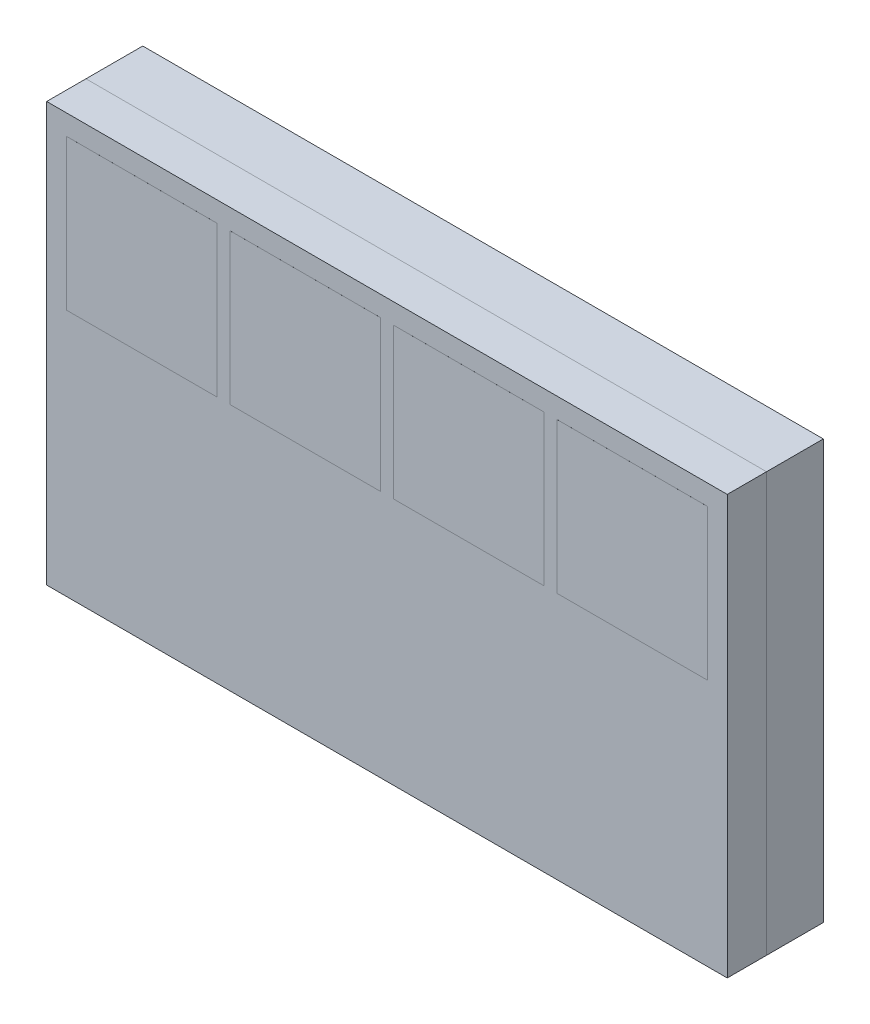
ISO-10303-21;
HEADER;
FILE_DESCRIPTION(('STEP AP214'),'2;1');
FILE_NAME('part.step','',(''),(''),'','','');
FILE_SCHEMA(('AUTOMOTIVE_DESIGN { 1 0 10303 214 1 1 1 1 }'));
ENDSEC;
DATA;
#1=APPLICATION_CONTEXT('core data for automotive mechanical design processes');
#2=APPLICATION_PROTOCOL_DEFINITION('international standard','automotive_design',2000,#1);
#3=PRODUCT_CONTEXT('',#1,'mechanical');
#4=PRODUCT('Part','Part','',(#3));
#5=PRODUCT_RELATED_PRODUCT_CATEGORY('part','',(#4));
#6=PRODUCT_DEFINITION_FORMATION('','',#4);
#7=PRODUCT_DEFINITION_CONTEXT('part definition',#1,'design');
#8=PRODUCT_DEFINITION('design','',#6,#7);
#9=PRODUCT_DEFINITION_SHAPE('','',#8);
#10=(LENGTH_UNIT() NAMED_UNIT(*) SI_UNIT(.MILLI.,.METRE.));
#11=(NAMED_UNIT(*) PLANE_ANGLE_UNIT() SI_UNIT($,.RADIAN.));
#12=(NAMED_UNIT(*) SI_UNIT($,.STERADIAN.) SOLID_ANGLE_UNIT());
#13=UNCERTAINTY_MEASURE_WITH_UNIT(LENGTH_MEASURE(1.E-05),#10,'distance_accuracy_value','');
#14=(GEOMETRIC_REPRESENTATION_CONTEXT(3) GLOBAL_UNCERTAINTY_ASSIGNED_CONTEXT((#13)) GLOBAL_UNIT_ASSIGNED_CONTEXT((#10,
#11,#12)) REPRESENTATION_CONTEXT('',''));
#15=CARTESIAN_POINT('',(0.,0.,0.));
#16=DIRECTION('',(0.,0.,1.));
#17=DIRECTION('',(1.,0.,0.));
#18=AXIS2_PLACEMENT_3D('',#15,#16,#17);
#19=CARTESIAN_POINT('',(0.,0.,-0.734));
#20=DIRECTION('',(0.,0.,-1.));
#21=DIRECTION('',(-1.,0.,0.));
#22=AXIS2_PLACEMENT_3D('',#19,#20,#21);
#23=PLANE('',#22);
#24=DIRECTION('',(-1.,0.,0.));
#25=VECTOR('',#24,1.);
#26=CARTESIAN_POINT('',(2.6,-2.47,-0.734));
#27=LINE('',#26,#25);
#28=CARTESIAN_POINT('',(2.6,-2.47,-0.734));
#29=VERTEX_POINT('',#28);
#30=CARTESIAN_POINT('',(-2.6,-2.47,-0.734));
#31=VERTEX_POINT('',#30);
#32=EDGE_CURVE('E560',#29,#31,#27,.T.);
#33=ORIENTED_EDGE('',*,*,#32,.T.);
#34=DIRECTION('',(0.,1.,0.));
#35=VECTOR('',#34,1.);
#36=CARTESIAN_POINT('',(-2.6,-2.47,-0.734));
#37=LINE('',#36,#35);
#38=CARTESIAN_POINT('',(-2.6,0.730000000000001,-0.734));
#39=VERTEX_POINT('',#38);
#40=EDGE_CURVE('E564',#31,#39,#37,.T.);
#41=ORIENTED_EDGE('',*,*,#40,.T.);
#42=DIRECTION('',(1.,0.,0.));
#43=VECTOR('',#42,1.);
#44=CARTESIAN_POINT('',(-2.6,0.730000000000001,-0.734));
#45=LINE('',#44,#43);
#46=CARTESIAN_POINT('',(2.6,0.730000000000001,-0.734));
#47=VERTEX_POINT('',#46);
#48=EDGE_CURVE('E568',#39,#47,#45,.T.);
#49=ORIENTED_EDGE('',*,*,#48,.T.);
#50=DIRECTION('',(0.,-1.,0.));
#51=VECTOR('',#50,1.);
#52=CARTESIAN_POINT('',(2.6,0.730000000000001,-0.734));
#53=LINE('',#52,#51);
#54=EDGE_CURVE('E571',#47,#29,#53,.T.);
#55=ORIENTED_EDGE('',*,*,#54,.T.);
#56=EDGE_LOOP('',(#33,#41,#49,#55));
#57=FACE_BOUND('',#56,.T.);
#58=DIRECTION('',(0.,-1.,0.));
#59=VECTOR('',#58,1.);
#60=CARTESIAN_POINT('',(2.19999999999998,-1.37,-0.734));
#61=LINE('',#60,#59);
#62=CARTESIAN_POINT('',(2.19999999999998,-1.37,-0.734));
#63=VERTEX_POINT('',#62);
#64=CARTESIAN_POINT('',(2.19999999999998,-1.99,-0.734));
#65=VERTEX_POINT('',#64);
#66=EDGE_CURVE('E509',#63,#65,#61,.T.);
#67=ORIENTED_EDGE('',*,*,#66,.F.);
#68=CARTESIAN_POINT('',(1.89999999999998,-1.37,-0.734));
#69=DIRECTION('',(0.,0.,-1.));
#70=DIRECTION('',(-1.,0.,0.));
#71=AXIS2_PLACEMENT_3D('',#68,#69,#70);
#72=CIRCLE('',#71,0.3);
#73=CARTESIAN_POINT('',(1.89999999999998,-1.07,-0.734));
#74=VERTEX_POINT('',#73);
#75=EDGE_CURVE('E478',#74,#63,#72,.T.);
#76=ORIENTED_EDGE('',*,*,#75,.F.);
#77=DIRECTION('',(1.,0.,0.));
#78=VECTOR('',#77,1.);
#79=CARTESIAN_POINT('',(1.89999999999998,-1.07,-0.734));
#80=LINE('',#79,#78);
#81=CARTESIAN_POINT('',(0.499999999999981,-1.07,-0.734));
#82=VERTEX_POINT('',#81);
#83=EDGE_CURVE('E484',#82,#74,#80,.T.);
#84=ORIENTED_EDGE('',*,*,#83,.F.);
#85=CARTESIAN_POINT('',(0.499999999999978,-1.37,-0.734));
#86=DIRECTION('',(0.,0.,-1.));
#87=DIRECTION('',(-1.,0.,0.));
#88=AXIS2_PLACEMENT_3D('',#85,#86,#87);
#89=CIRCLE('',#88,0.3);
#90=CARTESIAN_POINT('',(0.199999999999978,-1.37,-0.734));
#91=VERTEX_POINT('',#90);
#92=EDGE_CURVE('E524',#91,#82,#89,.T.);
#93=ORIENTED_EDGE('',*,*,#92,.F.);
#94=DIRECTION('',(0.,1.,0.));
#95=VECTOR('',#94,1.);
#96=CARTESIAN_POINT('',(0.199999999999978,-1.37,-0.734));
#97=LINE('',#96,#95);
#98=CARTESIAN_POINT('',(0.199999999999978,-1.99,-0.734));
#99=VERTEX_POINT('',#98);
#100=EDGE_CURVE('E521',#99,#91,#97,.T.);
#101=ORIENTED_EDGE('',*,*,#100,.F.);
#102=CARTESIAN_POINT('',(0.499999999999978,-1.99,-0.734));
#103=DIRECTION('',(0.,0.,-1.));
#104=DIRECTION('',(-1.,0.,0.));
#105=AXIS2_PLACEMENT_3D('',#102,#103,#104);
#106=CIRCLE('',#105,0.3);
#107=CARTESIAN_POINT('',(0.499999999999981,-2.29,-0.734));
#108=VERTEX_POINT('',#107);
#109=EDGE_CURVE('E518',#108,#99,#106,.T.);
#110=ORIENTED_EDGE('',*,*,#109,.F.);
#111=DIRECTION('',(-1.,0.,0.));
#112=VECTOR('',#111,1.);
#113=CARTESIAN_POINT('',(1.89999999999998,-2.29,-0.734));
#114=LINE('',#113,#112);
#115=CARTESIAN_POINT('',(1.89999999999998,-2.29,-0.734));
#116=VERTEX_POINT('',#115);
#117=EDGE_CURVE('E515',#116,#108,#114,.T.);
#118=ORIENTED_EDGE('',*,*,#117,.F.);
#119=CARTESIAN_POINT('',(1.89999999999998,-1.99,-0.734));
#120=DIRECTION('',(0.,0.,-1.));
#121=DIRECTION('',(-1.,0.,0.));
#122=AXIS2_PLACEMENT_3D('',#119,#120,#121);
#123=CIRCLE('',#122,0.3);
#124=EDGE_CURVE('E512',#65,#116,#123,.T.);
#125=ORIENTED_EDGE('',*,*,#124,.F.);
#126=EDGE_LOOP('',(#67,#76,#84,#93,#101,#110,#118,#125));
#127=FACE_BOUND('',#126,.T.);
#128=DIRECTION('',(-1.,0.,0.));
#129=VECTOR('',#128,1.);
#130=CARTESIAN_POINT('',(-0.500000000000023,-2.29,-0.734));
#131=LINE('',#130,#129);
#132=CARTESIAN_POINT('',(-0.500000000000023,-2.29,-0.734));
#133=VERTEX_POINT('',#132);
#134=CARTESIAN_POINT('',(-1.90000000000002,-2.29,-0.734));
#135=VERTEX_POINT('',#134);
#136=EDGE_CURVE('E428',#133,#135,#131,.T.);
#137=ORIENTED_EDGE('',*,*,#136,.F.);
#138=CARTESIAN_POINT('',(-0.500000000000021,-1.99,-0.734));
#139=DIRECTION('',(0.,0.,-1.));
#140=DIRECTION('',(-1.,0.,0.));
#141=AXIS2_PLACEMENT_3D('',#138,#139,#140);
#142=CIRCLE('',#141,0.3);
#143=CARTESIAN_POINT('',(-0.200000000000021,-1.99,-0.734));
#144=VERTEX_POINT('',#143);
#145=EDGE_CURVE('E397',#144,#133,#142,.T.);
#146=ORIENTED_EDGE('',*,*,#145,.F.);
#147=DIRECTION('',(0.,-1.,0.));
#148=VECTOR('',#147,1.);
#149=CARTESIAN_POINT('',(-0.200000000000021,-1.47,-0.734));
#150=LINE('',#149,#148);
#151=CARTESIAN_POINT('',(-0.200000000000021,-1.47,-0.734));
#152=VERTEX_POINT('',#151);
#153=EDGE_CURVE('E403',#152,#144,#150,.T.);
#154=ORIENTED_EDGE('',*,*,#153,.F.);
#155=DIRECTION('',(0.707106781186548,-0.707106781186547,0.));
#156=VECTOR('',#155,1.);
#157=CARTESIAN_POINT('',(-0.200000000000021,-1.47,-0.734));
#158=LINE('',#157,#156);
#159=CARTESIAN_POINT('',(-0.600000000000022,-1.07,-0.734));
#160=VERTEX_POINT('',#159);
#161=EDGE_CURVE('E443',#160,#152,#158,.T.);
#162=ORIENTED_EDGE('',*,*,#161,.F.);
#163=DIRECTION('',(1.,0.,0.));
#164=VECTOR('',#163,1.);
#165=CARTESIAN_POINT('',(-0.600000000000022,-1.07,-0.734));
#166=LINE('',#165,#164);
#167=CARTESIAN_POINT('',(-1.90000000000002,-1.07,-0.734));
#168=VERTEX_POINT('',#167);
#169=EDGE_CURVE('E440',#168,#160,#166,.T.);
#170=ORIENTED_EDGE('',*,*,#169,.F.);
#171=CARTESIAN_POINT('',(-1.90000000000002,-1.37,-0.734));
#172=DIRECTION('',(0.,0.,-1.));
#173=DIRECTION('',(-1.,0.,0.));
#174=AXIS2_PLACEMENT_3D('',#171,#172,#173);
#175=CIRCLE('',#174,0.3);
#176=CARTESIAN_POINT('',(-2.20000000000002,-1.37,-0.734));
#177=VERTEX_POINT('',#176);
#178=EDGE_CURVE('E437',#177,#168,#175,.T.);
#179=ORIENTED_EDGE('',*,*,#178,.F.);
#180=DIRECTION('',(0.,1.,0.));
#181=VECTOR('',#180,1.);
#182=CARTESIAN_POINT('',(-2.20000000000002,-1.37,-0.734));
#183=LINE('',#182,#181);
#184=CARTESIAN_POINT('',(-2.20000000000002,-1.99,-0.734));
#185=VERTEX_POINT('',#184);
#186=EDGE_CURVE('E434',#185,#177,#183,.T.);
#187=ORIENTED_EDGE('',*,*,#186,.F.);
#188=CARTESIAN_POINT('',(-1.90000000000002,-1.99,-0.734));
#189=DIRECTION('',(0.,0.,-1.));
#190=DIRECTION('',(-1.,0.,0.));
#191=AXIS2_PLACEMENT_3D('',#188,#189,#190);
#192=CIRCLE('',#191,0.3);
#193=EDGE_CURVE('E431',#135,#185,#192,.T.);
#194=ORIENTED_EDGE('',*,*,#193,.F.);
#195=EDGE_LOOP('',(#137,#146,#154,#162,#170,#179,#187,#194));
#196=FACE_BOUND('',#195,.T.);
#197=DIRECTION('',(0.,1.,0.));
#198=VECTOR('',#197,1.);
#199=CARTESIAN_POINT('',(-2.2,0.249999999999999,-0.734));
#200=LINE('',#199,#198);
#201=CARTESIAN_POINT('',(-2.2,-0.369999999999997,-0.734));
#202=VERTEX_POINT('',#201);
#203=CARTESIAN_POINT('',(-2.2,0.249999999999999,-0.734));
#204=VERTEX_POINT('',#203);
#205=EDGE_CURVE('E317',#202,#204,#200,.T.);
#206=ORIENTED_EDGE('',*,*,#205,.F.);
#207=CARTESIAN_POINT('',(-1.9,-0.369999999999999,-0.734));
#208=DIRECTION('',(0.,0.,-1.));
#209=DIRECTION('',(-1.,0.,0.));
#210=AXIS2_PLACEMENT_3D('',#207,#208,#209);
#211=CIRCLE('',#210,0.3);
#212=CARTESIAN_POINT('',(-1.9,-0.669999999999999,-0.734));
#213=VERTEX_POINT('',#212);
#214=EDGE_CURVE('E312',#213,#202,#211,.T.);
#215=ORIENTED_EDGE('',*,*,#214,.F.);
#216=DIRECTION('',(-1.,0.,0.));
#217=VECTOR('',#216,1.);
#218=CARTESIAN_POINT('',(-0.500000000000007,-0.669999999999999,-0.734));
#219=LINE('',#218,#217);
#220=CARTESIAN_POINT('',(-0.500000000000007,-0.669999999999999,-0.734));
#221=VERTEX_POINT('',#220);
#222=EDGE_CURVE('E328',#221,#213,#219,.T.);
#223=ORIENTED_EDGE('',*,*,#222,.F.);
#224=CARTESIAN_POINT('',(-0.500000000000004,-0.369999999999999,-0.734));
#225=DIRECTION('',(0.,0.,-1.));
#226=DIRECTION('',(-1.,0.,0.));
#227=AXIS2_PLACEMENT_3D('',#224,#225,#226);
#228=CIRCLE('',#227,0.3);
#229=CARTESIAN_POINT('',(-0.200000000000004,-0.369999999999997,-0.734));
#230=VERTEX_POINT('',#229);
#231=EDGE_CURVE('E364',#230,#221,#228,.T.);
#232=ORIENTED_EDGE('',*,*,#231,.F.);
#233=DIRECTION('',(0.,-1.,0.));
#234=VECTOR('',#233,1.);
#235=CARTESIAN_POINT('',(-0.200000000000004,0.249999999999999,-0.734));
#236=LINE('',#235,#234);
#237=CARTESIAN_POINT('',(-0.200000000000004,0.249999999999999,-0.734));
#238=VERTEX_POINT('',#237);
#239=EDGE_CURVE('E361',#238,#230,#236,.T.);
#240=ORIENTED_EDGE('',*,*,#239,.F.);
#241=CARTESIAN_POINT('',(-0.500000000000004,0.250000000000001,-0.734));
#242=DIRECTION('',(0.,0.,-1.));
#243=DIRECTION('',(1.,0.,0.));
#244=AXIS2_PLACEMENT_3D('',#241,#242,#243);
#245=CIRCLE('',#244,0.3);
#246=CARTESIAN_POINT('',(-0.500000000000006,0.550000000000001,-0.734));
#247=VERTEX_POINT('',#246);
#248=EDGE_CURVE('E358',#247,#238,#245,.T.);
#249=ORIENTED_EDGE('',*,*,#248,.F.);
#250=DIRECTION('',(1.,0.,0.));
#251=VECTOR('',#250,1.);
#252=CARTESIAN_POINT('',(-0.500000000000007,0.550000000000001,-0.734));
#253=LINE('',#252,#251);
#254=CARTESIAN_POINT('',(-1.9,0.550000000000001,-0.734));
#255=VERTEX_POINT('',#254);
#256=EDGE_CURVE('E355',#255,#247,#253,.T.);
#257=ORIENTED_EDGE('',*,*,#256,.F.);
#258=CARTESIAN_POINT('',(-1.9,0.250000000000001,-0.734));
#259=DIRECTION('',(0.,0.,-1.));
#260=DIRECTION('',(1.,0.,0.));
#261=AXIS2_PLACEMENT_3D('',#258,#259,#260);
#262=CIRCLE('',#261,0.3);
#263=EDGE_CURVE('E352',#204,#255,#262,.T.);
#264=ORIENTED_EDGE('',*,*,#263,.F.);
#265=EDGE_LOOP('',(#206,#215,#223,#232,#240,#249,#257,#264));
#266=FACE_BOUND('',#265,.T.);
#267=DIRECTION('',(0.,1.,0.));
#268=VECTOR('',#267,1.);
#269=CARTESIAN_POINT('',(0.199999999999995,0.249999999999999,-0.734));
#270=LINE('',#269,#268);
#271=CARTESIAN_POINT('',(0.199999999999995,-0.369999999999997,-0.734));
#272=VERTEX_POINT('',#271);
#273=CARTESIAN_POINT('',(0.199999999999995,0.249999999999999,-0.734));
#274=VERTEX_POINT('',#273);
#275=EDGE_CURVE('E1023',#272,#274,#270,.T.);
#276=ORIENTED_EDGE('',*,*,#275,.F.);
#277=CARTESIAN_POINT('',(0.499999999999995,-0.369999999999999,-0.734));
#278=DIRECTION('',(0.,0.,-1.));
#279=DIRECTION('',(-1.,0.,0.));
#280=AXIS2_PLACEMENT_3D('',#277,#278,#279);
#281=CIRCLE('',#280,0.3);
#282=CARTESIAN_POINT('',(0.499999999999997,-0.669999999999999,-0.734));
#283=VERTEX_POINT('',#282);
#284=EDGE_CURVE('E309',#283,#272,#281,.T.);
#285=ORIENTED_EDGE('',*,*,#284,.F.);
#286=DIRECTION('',(-1.,0.,0.));
#287=VECTOR('',#286,1.);
#288=CARTESIAN_POINT('',(1.89999999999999,-0.669999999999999,-0.734));
#289=LINE('',#288,#287);
#290=CARTESIAN_POINT('',(1.89999999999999,-0.669999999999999,-0.734));
#291=VERTEX_POINT('',#290);
#292=EDGE_CURVE('E305',#291,#283,#289,.T.);
#293=ORIENTED_EDGE('',*,*,#292,.F.);
#294=CARTESIAN_POINT('',(1.9,-0.369999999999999,-0.734));
#295=DIRECTION('',(0.,0.,-1.));
#296=DIRECTION('',(1.,0.,0.));
#297=AXIS2_PLACEMENT_3D('',#294,#295,#296);
#298=CIRCLE('',#297,0.3);
#299=CARTESIAN_POINT('',(2.2,-0.369999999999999,-0.734));
#300=VERTEX_POINT('',#299);
#301=EDGE_CURVE('E1018',#300,#291,#298,.T.);
#302=ORIENTED_EDGE('',*,*,#301,.F.);
#303=DIRECTION('',(0.,-1.,0.));
#304=VECTOR('',#303,1.);
#305=CARTESIAN_POINT('',(2.2,0.249999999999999,-0.734));
#306=LINE('',#305,#304);
#307=CARTESIAN_POINT('',(2.2,0.249999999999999,-0.734));
#308=VERTEX_POINT('',#307);
#309=EDGE_CURVE('E1040',#308,#300,#306,.T.);
#310=ORIENTED_EDGE('',*,*,#309,.F.);
#311=CARTESIAN_POINT('',(1.9,0.250000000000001,-0.734));
#312=DIRECTION('',(0.,0.,-1.));
#313=DIRECTION('',(1.,0.,0.));
#314=AXIS2_PLACEMENT_3D('',#311,#312,#313);
#315=CIRCLE('',#314,0.3);
#316=CARTESIAN_POINT('',(1.89999999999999,0.550000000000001,-0.734));
#317=VERTEX_POINT('',#316);
#318=EDGE_CURVE('E1037',#317,#308,#315,.T.);
#319=ORIENTED_EDGE('',*,*,#318,.F.);
#320=DIRECTION('',(1.,0.,0.));
#321=VECTOR('',#320,1.);
#322=CARTESIAN_POINT('',(1.89999999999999,0.550000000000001,-0.734));
#323=LINE('',#322,#321);
#324=CARTESIAN_POINT('',(0.499999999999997,0.550000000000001,-0.734));
#325=VERTEX_POINT('',#324);
#326=EDGE_CURVE('E1034',#325,#317,#323,.T.);
#327=ORIENTED_EDGE('',*,*,#326,.F.);
#328=CARTESIAN_POINT('',(0.499999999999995,0.250000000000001,-0.734));
#329=DIRECTION('',(0.,0.,-1.));
#330=DIRECTION('',(-1.,0.,0.));
#331=AXIS2_PLACEMENT_3D('',#328,#329,#330);
#332=CIRCLE('',#331,0.3);
#333=EDGE_CURVE('E1027',#274,#325,#332,.T.);
#334=ORIENTED_EDGE('',*,*,#333,.F.);
#335=EDGE_LOOP('',(#276,#285,#293,#302,#310,#319,#327,#334));
#336=FACE_BOUND('',#335,.T.);
#337=ADVANCED_FACE('F49',(#57,#127,#196,#266,#336),#23,.T.);
#338=CARTESIAN_POINT('',(2.6,-2.47,-0.734));
#339=DIRECTION('',(0.,1.,0.));
#340=DIRECTION('',(-1.,0.,0.));
#341=AXIS2_PLACEMENT_3D('',#338,#339,#340);
#342=PLANE('',#341);
#343=DIRECTION('',(-1.,0.,0.));
#344=VECTOR('',#343,1.);
#345=CARTESIAN_POINT('',(2.6,-2.47,-0.3));
#346=LINE('',#345,#344);
#347=CARTESIAN_POINT('',(2.6,-2.47,-0.3));
#348=VERTEX_POINT('',#347);
#349=CARTESIAN_POINT('',(-2.6,-2.47,-0.3));
#350=VERTEX_POINT('',#349);
#351=EDGE_CURVE('E559',#348,#350,#346,.T.);
#352=ORIENTED_EDGE('',*,*,#351,.T.);
#353=DIRECTION('',(0.,0.,1.));
#354=VECTOR('',#353,1.);
#355=CARTESIAN_POINT('',(-2.6,-2.47,-0.734));
#356=LINE('',#355,#354);
#357=EDGE_CURVE('E12',#31,#350,#356,.T.);
#358=ORIENTED_EDGE('',*,*,#357,.F.);
#359=ORIENTED_EDGE('',*,*,#32,.F.);
#360=DIRECTION('',(0.,0.,1.));
#361=VECTOR('',#360,1.);
#362=CARTESIAN_POINT('',(2.6,-2.47,-0.734));
#363=LINE('',#362,#361);
#364=EDGE_CURVE('E574',#29,#348,#363,.T.);
#365=ORIENTED_EDGE('',*,*,#364,.T.);
#366=EDGE_LOOP('',(#352,#358,#359,#365));
#367=FACE_BOUND('',#366,.T.);
#368=ADVANCED_FACE('F51',(#367),#342,.F.);
#369=CARTESIAN_POINT('',(-2.6,-2.47,-0.734));
#370=DIRECTION('',(1.,0.,0.));
#371=DIRECTION('',(0.,0.,-1.));
#372=AXIS2_PLACEMENT_3D('',#369,#370,#371);
#373=PLANE('',#372);
#374=DIRECTION('',(0.,1.,0.));
#375=VECTOR('',#374,1.);
#376=CARTESIAN_POINT('',(-2.6,-2.47,-0.3));
#377=LINE('',#376,#375);
#378=CARTESIAN_POINT('',(-2.6,0.730000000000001,-0.3));
#379=VERTEX_POINT('',#378);
#380=EDGE_CURVE('E578',#350,#379,#377,.T.);
#381=ORIENTED_EDGE('',*,*,#380,.T.);
#382=DIRECTION('',(0.,0.,1.));
#383=VECTOR('',#382,1.);
#384=CARTESIAN_POINT('',(-2.6,0.730000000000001,-0.734));
#385=LINE('',#384,#383);
#386=EDGE_CURVE('E58',#39,#379,#385,.T.);
#387=ORIENTED_EDGE('',*,*,#386,.F.);
#388=ORIENTED_EDGE('',*,*,#40,.F.);
#389=ORIENTED_EDGE('',*,*,#357,.T.);
#390=EDGE_LOOP('',(#381,#387,#388,#389));
#391=FACE_BOUND('',#390,.T.);
#392=ADVANCED_FACE('F614',(#391),#373,.F.);
#393=CARTESIAN_POINT('',(-2.6,0.730000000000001,-0.734));
#394=DIRECTION('',(0.,-1.,0.));
#395=DIRECTION('',(1.,0.,0.));
#396=AXIS2_PLACEMENT_3D('',#393,#394,#395);
#397=PLANE('',#396);
#398=DIRECTION('',(1.,0.,0.));
#399=VECTOR('',#398,1.);
#400=CARTESIAN_POINT('',(-2.6,0.730000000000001,-0.3));
#401=LINE('',#400,#399);
#402=CARTESIAN_POINT('',(2.6,0.730000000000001,-0.3));
#403=VERTEX_POINT('',#402);
#404=EDGE_CURVE('E581',#379,#403,#401,.T.);
#405=ORIENTED_EDGE('',*,*,#404,.T.);
#406=DIRECTION('',(0.,0.,1.));
#407=VECTOR('',#406,1.);
#408=CARTESIAN_POINT('',(2.6,0.730000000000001,-0.734));
#409=LINE('',#408,#407);
#410=EDGE_CURVE('E589',#47,#403,#409,.T.);
#411=ORIENTED_EDGE('',*,*,#410,.F.);
#412=ORIENTED_EDGE('',*,*,#48,.F.);
#413=ORIENTED_EDGE('',*,*,#386,.T.);
#414=EDGE_LOOP('',(#405,#411,#412,#413));
#415=FACE_BOUND('',#414,.T.);
#416=ADVANCED_FACE('F598',(#415),#397,.F.);
#417=CARTESIAN_POINT('',(2.6,0.730000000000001,-0.734));
#418=DIRECTION('',(-1.,0.,0.));
#419=DIRECTION('',(0.,-1.,0.));
#420=AXIS2_PLACEMENT_3D('',#417,#418,#419);
#421=PLANE('',#420);
#422=DIRECTION('',(0.,-1.,0.));
#423=VECTOR('',#422,1.);
#424=CARTESIAN_POINT('',(2.6,0.730000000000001,-0.3));
#425=LINE('',#424,#423);
#426=EDGE_CURVE('E565',#403,#348,#425,.T.);
#427=ORIENTED_EDGE('',*,*,#426,.T.);
#428=ORIENTED_EDGE('',*,*,#364,.F.);
#429=ORIENTED_EDGE('',*,*,#54,.F.);
#430=ORIENTED_EDGE('',*,*,#410,.T.);
#431=EDGE_LOOP('',(#427,#428,#429,#430));
#432=FACE_BOUND('',#431,.T.);
#433=ADVANCED_FACE('F607',(#432),#421,.F.);
#434=CARTESIAN_POINT('',(0.,0.,-0.3));
#435=DIRECTION('',(0.,0.,-1.));
#436=DIRECTION('',(-1.,0.,0.));
#437=AXIS2_PLACEMENT_3D('',#434,#435,#436);
#438=PLANE('',#437);
#439=ORIENTED_EDGE('',*,*,#351,.F.);
#440=ORIENTED_EDGE('',*,*,#426,.F.);
#441=ORIENTED_EDGE('',*,*,#404,.F.);
#442=ORIENTED_EDGE('',*,*,#380,.F.);
#443=EDGE_LOOP('',(#439,#440,#441,#442));
#444=FACE_BOUND('',#443,.T.);
#445=ADVANCED_FACE('F604',(#444),#438,.F.);
#446=CARTESIAN_POINT('',(1.89999999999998,-1.37,-0.79));
#447=DIRECTION('',(0.,0.,1.));
#448=DIRECTION('',(1.,0.,0.));
#449=AXIS2_PLACEMENT_3D('',#446,#447,#448);
#450=CYLINDRICAL_SURFACE('',#449,0.3);
#451=ORIENTED_EDGE('',*,*,#75,.T.);
#452=DIRECTION('',(0.,0.,1.));
#453=VECTOR('',#452,1.);
#454=CARTESIAN_POINT('',(2.19999999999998,-1.37,-0.79));
#455=LINE('',#454,#453);
#456=CARTESIAN_POINT('',(2.19999999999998,-1.37,-0.79));
#457=VERTEX_POINT('',#456);
#458=EDGE_CURVE('E556',#457,#63,#455,.T.);
#459=ORIENTED_EDGE('',*,*,#458,.F.);
#460=CARTESIAN_POINT('',(1.89999999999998,-1.37,-0.79));
#461=DIRECTION('',(0.,0.,-1.));
#462=DIRECTION('',(-1.,0.,0.));
#463=AXIS2_PLACEMENT_3D('',#460,#461,#462);
#464=CIRCLE('',#463,0.3);
#465=CARTESIAN_POINT('',(1.89999999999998,-1.07,-0.79));
#466=VERTEX_POINT('',#465);
#467=EDGE_CURVE('E479',#466,#457,#464,.T.);
#468=ORIENTED_EDGE('',*,*,#467,.F.);
#469=DIRECTION('',(0.,0.,1.));
#470=VECTOR('',#469,1.);
#471=CARTESIAN_POINT('',(1.89999999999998,-1.07,-0.79));
#472=LINE('',#471,#470);
#473=EDGE_CURVE('E505',#466,#74,#472,.T.);
#474=ORIENTED_EDGE('',*,*,#473,.T.);
#475=EDGE_LOOP('',(#451,#459,#468,#474));
#476=FACE_BOUND('',#475,.T.);
#477=ADVANCED_FACE('F627',(#476),#450,.T.);
#478=CARTESIAN_POINT('',(2.19999999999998,-1.37,-0.79));
#479=DIRECTION('',(-1.,0.,0.));
#480=DIRECTION('',(0.,0.,1.));
#481=AXIS2_PLACEMENT_3D('',#478,#479,#480);
#482=PLANE('',#481);
#483=ORIENTED_EDGE('',*,*,#66,.T.);
#484=DIRECTION('',(0.,0.,1.));
#485=VECTOR('',#484,1.);
#486=CARTESIAN_POINT('',(2.19999999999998,-1.99,-0.79));
#487=LINE('',#486,#485);
#488=CARTESIAN_POINT('',(2.19999999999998,-1.99,-0.79));
#489=VERTEX_POINT('',#488);
#490=EDGE_CURVE('E552',#489,#65,#487,.T.);
#491=ORIENTED_EDGE('',*,*,#490,.F.);
#492=DIRECTION('',(0.,-1.,0.));
#493=VECTOR('',#492,1.);
#494=CARTESIAN_POINT('',(2.19999999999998,-1.37,-0.79));
#495=LINE('',#494,#493);
#496=EDGE_CURVE('E483',#457,#489,#495,.T.);
#497=ORIENTED_EDGE('',*,*,#496,.F.);
#498=ORIENTED_EDGE('',*,*,#458,.T.);
#499=EDGE_LOOP('',(#483,#491,#497,#498));
#500=FACE_BOUND('',#499,.T.);
#501=ADVANCED_FACE('F646',(#500),#482,.F.);
#502=CARTESIAN_POINT('',(1.89999999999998,-1.99,-0.79));
#503=DIRECTION('',(0.,0.,1.));
#504=DIRECTION('',(1.,0.,0.));
#505=AXIS2_PLACEMENT_3D('',#502,#503,#504);
#506=CYLINDRICAL_SURFACE('',#505,0.3);
#507=ORIENTED_EDGE('',*,*,#124,.T.);
#508=DIRECTION('',(0.,0.,1.));
#509=VECTOR('',#508,1.);
#510=CARTESIAN_POINT('',(1.89999999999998,-2.29,-0.79));
#511=LINE('',#510,#509);
#512=CARTESIAN_POINT('',(1.89999999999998,-2.29,-0.79));
#513=VERTEX_POINT('',#512);
#514=EDGE_CURVE('E548',#513,#116,#511,.T.);
#515=ORIENTED_EDGE('',*,*,#514,.F.);
#516=CARTESIAN_POINT('',(1.89999999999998,-1.99,-0.79));
#517=DIRECTION('',(0.,0.,-1.));
#518=DIRECTION('',(-1.,0.,0.));
#519=AXIS2_PLACEMENT_3D('',#516,#517,#518);
#520=CIRCLE('',#519,0.3);
#521=EDGE_CURVE('E487',#489,#513,#520,.T.);
#522=ORIENTED_EDGE('',*,*,#521,.F.);
#523=ORIENTED_EDGE('',*,*,#490,.T.);
#524=EDGE_LOOP('',(#507,#515,#522,#523));
#525=FACE_BOUND('',#524,.T.);
#526=ADVANCED_FACE('F653',(#525),#506,.T.);
#527=CARTESIAN_POINT('',(1.89999999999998,-2.29,-0.79));
#528=DIRECTION('',(0.,1.,0.));
#529=DIRECTION('',(0.,0.,1.));
#530=AXIS2_PLACEMENT_3D('',#527,#528,#529);
#531=PLANE('',#530);
#532=ORIENTED_EDGE('',*,*,#117,.T.);
#533=DIRECTION('',(0.,0.,1.));
#534=VECTOR('',#533,1.);
#535=CARTESIAN_POINT('',(0.499999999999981,-2.29,-0.79));
#536=LINE('',#535,#534);
#537=CARTESIAN_POINT('',(0.499999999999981,-2.29,-0.79));
#538=VERTEX_POINT('',#537);
#539=EDGE_CURVE('E544',#538,#108,#536,.T.);
#540=ORIENTED_EDGE('',*,*,#539,.F.);
#541=DIRECTION('',(-1.,0.,0.));
#542=VECTOR('',#541,1.);
#543=CARTESIAN_POINT('',(1.89999999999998,-2.29,-0.79));
#544=LINE('',#543,#542);
#545=EDGE_CURVE('E490',#513,#538,#544,.T.);
#546=ORIENTED_EDGE('',*,*,#545,.F.);
#547=ORIENTED_EDGE('',*,*,#514,.T.);
#548=EDGE_LOOP('',(#532,#540,#546,#547));
#549=FACE_BOUND('',#548,.T.);
#550=ADVANCED_FACE('F660',(#549),#531,.F.);
#551=CARTESIAN_POINT('',(0.499999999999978,-1.99,-0.79));
#552=DIRECTION('',(0.,0.,1.));
#553=DIRECTION('',(1.,0.,0.));
#554=AXIS2_PLACEMENT_3D('',#551,#552,#553);
#555=CYLINDRICAL_SURFACE('',#554,0.3);
#556=ORIENTED_EDGE('',*,*,#109,.T.);
#557=DIRECTION('',(0.,0.,1.));
#558=VECTOR('',#557,1.);
#559=CARTESIAN_POINT('',(0.199999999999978,-1.99,-0.79));
#560=LINE('',#559,#558);
#561=CARTESIAN_POINT('',(0.199999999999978,-1.99,-0.79));
#562=VERTEX_POINT('',#561);
#563=EDGE_CURVE('E540',#562,#99,#560,.T.);
#564=ORIENTED_EDGE('',*,*,#563,.F.);
#565=CARTESIAN_POINT('',(0.499999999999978,-1.99,-0.79));
#566=DIRECTION('',(0.,0.,-1.));
#567=DIRECTION('',(-1.,0.,0.));
#568=AXIS2_PLACEMENT_3D('',#565,#566,#567);
#569=CIRCLE('',#568,0.3);
#570=EDGE_CURVE('E493',#538,#562,#569,.T.);
#571=ORIENTED_EDGE('',*,*,#570,.F.);
#572=ORIENTED_EDGE('',*,*,#539,.T.);
#573=EDGE_LOOP('',(#556,#564,#571,#572));
#574=FACE_BOUND('',#573,.T.);
#575=ADVANCED_FACE('F668',(#574),#555,.T.);
#576=CARTESIAN_POINT('',(0.199999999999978,-1.37,-0.79));
#577=DIRECTION('',(1.,0.,0.));
#578=DIRECTION('',(0.,0.,-1.));
#579=AXIS2_PLACEMENT_3D('',#576,#577,#578);
#580=PLANE('',#579);
#581=ORIENTED_EDGE('',*,*,#100,.T.);
#582=DIRECTION('',(0.,0.,1.));
#583=VECTOR('',#582,1.);
#584=CARTESIAN_POINT('',(0.199999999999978,-1.37,-0.79));
#585=LINE('',#584,#583);
#586=CARTESIAN_POINT('',(0.199999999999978,-1.37,-0.79));
#587=VERTEX_POINT('',#586);
#588=EDGE_CURVE('E536',#587,#91,#585,.T.);
#589=ORIENTED_EDGE('',*,*,#588,.F.);
#590=DIRECTION('',(0.,1.,0.));
#591=VECTOR('',#590,1.);
#592=CARTESIAN_POINT('',(0.199999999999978,-1.37,-0.79));
#593=LINE('',#592,#591);
#594=EDGE_CURVE('E496',#562,#587,#593,.T.);
#595=ORIENTED_EDGE('',*,*,#594,.F.);
#596=ORIENTED_EDGE('',*,*,#563,.T.);
#597=EDGE_LOOP('',(#581,#589,#595,#596));
#598=FACE_BOUND('',#597,.T.);
#599=ADVANCED_FACE('F676',(#598),#580,.F.);
#600=CARTESIAN_POINT('',(0.499999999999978,-1.37,-0.79));
#601=DIRECTION('',(0.,0.,1.));
#602=DIRECTION('',(1.,0.,0.));
#603=AXIS2_PLACEMENT_3D('',#600,#601,#602);
#604=CYLINDRICAL_SURFACE('',#603,0.3);
#605=ORIENTED_EDGE('',*,*,#92,.T.);
#606=DIRECTION('',(0.,0.,1.));
#607=VECTOR('',#606,1.);
#608=CARTESIAN_POINT('',(0.499999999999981,-1.07,-0.79));
#609=LINE('',#608,#607);
#610=CARTESIAN_POINT('',(0.499999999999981,-1.07,-0.79));
#611=VERTEX_POINT('',#610);
#612=EDGE_CURVE('E533',#611,#82,#609,.T.);
#613=ORIENTED_EDGE('',*,*,#612,.F.);
#614=CARTESIAN_POINT('',(0.499999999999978,-1.37,-0.79));
#615=DIRECTION('',(0.,0.,-1.));
#616=DIRECTION('',(-1.,0.,0.));
#617=AXIS2_PLACEMENT_3D('',#614,#615,#616);
#618=CIRCLE('',#617,0.3);
#619=EDGE_CURVE('E499',#587,#611,#618,.T.);
#620=ORIENTED_EDGE('',*,*,#619,.F.);
#621=ORIENTED_EDGE('',*,*,#588,.T.);
#622=EDGE_LOOP('',(#605,#613,#620,#621));
#623=FACE_BOUND('',#622,.T.);
#624=ADVANCED_FACE('F684',(#623),#604,.T.);
#625=CARTESIAN_POINT('',(1.89999999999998,-1.07,-0.79));
#626=DIRECTION('',(0.,-1.,0.));
#627=DIRECTION('',(0.,0.,-1.));
#628=AXIS2_PLACEMENT_3D('',#625,#626,#627);
#629=PLANE('',#628);
#630=ORIENTED_EDGE('',*,*,#83,.T.);
#631=ORIENTED_EDGE('',*,*,#473,.F.);
#632=DIRECTION('',(1.,0.,0.));
#633=VECTOR('',#632,1.);
#634=CARTESIAN_POINT('',(1.89999999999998,-1.07,-0.79));
#635=LINE('',#634,#633);
#636=EDGE_CURVE('E502',#611,#466,#635,.T.);
#637=ORIENTED_EDGE('',*,*,#636,.F.);
#638=ORIENTED_EDGE('',*,*,#612,.T.);
#639=EDGE_LOOP('',(#630,#631,#637,#638));
#640=FACE_BOUND('',#639,.T.);
#641=ADVANCED_FACE('F692',(#640),#629,.F.);
#642=CARTESIAN_POINT('',(1.89999999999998,-1.37,-0.79));
#643=DIRECTION('',(0.,0.,-1.));
#644=DIRECTION('',(-1.,0.,0.));
#645=AXIS2_PLACEMENT_3D('',#642,#643,#644);
#646=PLANE('',#645);
#647=ORIENTED_EDGE('',*,*,#467,.T.);
#648=ORIENTED_EDGE('',*,*,#496,.T.);
#649=ORIENTED_EDGE('',*,*,#521,.T.);
#650=ORIENTED_EDGE('',*,*,#545,.T.);
#651=ORIENTED_EDGE('',*,*,#570,.T.);
#652=ORIENTED_EDGE('',*,*,#594,.T.);
#653=ORIENTED_EDGE('',*,*,#619,.T.);
#654=ORIENTED_EDGE('',*,*,#636,.T.);
#655=EDGE_LOOP('',(#647,#648,#649,#650,#651,#652,#653,#654));
#656=FACE_BOUND('',#655,.T.);
#657=ADVANCED_FACE('F700',(#656),#646,.T.);
#658=CARTESIAN_POINT('',(-0.500000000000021,-1.99,-0.79));
#659=DIRECTION('',(0.,0.,1.));
#660=DIRECTION('',(1.,0.,0.));
#661=AXIS2_PLACEMENT_3D('',#658,#659,#660);
#662=CYLINDRICAL_SURFACE('',#661,0.3);
#663=ORIENTED_EDGE('',*,*,#145,.T.);
#664=DIRECTION('',(0.,0.,1.));
#665=VECTOR('',#664,1.);
#666=CARTESIAN_POINT('',(-0.500000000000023,-2.29,-0.79));
#667=LINE('',#666,#665);
#668=CARTESIAN_POINT('',(-0.500000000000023,-2.29,-0.79));
#669=VERTEX_POINT('',#668);
#670=EDGE_CURVE('E475',#669,#133,#667,.T.);
#671=ORIENTED_EDGE('',*,*,#670,.F.);
#672=CARTESIAN_POINT('',(-0.500000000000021,-1.99,-0.79));
#673=DIRECTION('',(0.,0.,-1.));
#674=DIRECTION('',(-1.,0.,0.));
#675=AXIS2_PLACEMENT_3D('',#672,#673,#674);
#676=CIRCLE('',#675,0.3);
#677=CARTESIAN_POINT('',(-0.200000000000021,-1.99,-0.79));
#678=VERTEX_POINT('',#677);
#679=EDGE_CURVE('E398',#678,#669,#676,.T.);
#680=ORIENTED_EDGE('',*,*,#679,.F.);
#681=DIRECTION('',(0.,0.,1.));
#682=VECTOR('',#681,1.);
#683=CARTESIAN_POINT('',(-0.200000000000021,-1.99,-0.79));
#684=LINE('',#683,#682);
#685=EDGE_CURVE('E424',#678,#144,#684,.T.);
#686=ORIENTED_EDGE('',*,*,#685,.T.);
#687=EDGE_LOOP('',(#663,#671,#680,#686));
#688=FACE_BOUND('',#687,.T.);
#689=ADVANCED_FACE('F708',(#688),#662,.T.);
#690=CARTESIAN_POINT('',(-0.500000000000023,-2.29,-0.79));
#691=DIRECTION('',(0.,1.,0.));
#692=DIRECTION('',(0.,0.,1.));
#693=AXIS2_PLACEMENT_3D('',#690,#691,#692);
#694=PLANE('',#693);
#695=ORIENTED_EDGE('',*,*,#136,.T.);
#696=DIRECTION('',(0.,0.,1.));
#697=VECTOR('',#696,1.);
#698=CARTESIAN_POINT('',(-1.90000000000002,-2.29,-0.79));
#699=LINE('',#698,#697);
#700=CARTESIAN_POINT('',(-1.90000000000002,-2.29,-0.79));
#701=VERTEX_POINT('',#700);
#702=EDGE_CURVE('E471',#701,#135,#699,.T.);
#703=ORIENTED_EDGE('',*,*,#702,.F.);
#704=DIRECTION('',(-1.,0.,0.));
#705=VECTOR('',#704,1.);
#706=CARTESIAN_POINT('',(-0.500000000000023,-2.29,-0.79));
#707=LINE('',#706,#705);
#708=EDGE_CURVE('E402',#669,#701,#707,.T.);
#709=ORIENTED_EDGE('',*,*,#708,.F.);
#710=ORIENTED_EDGE('',*,*,#670,.T.);
#711=EDGE_LOOP('',(#695,#703,#709,#710));
#712=FACE_BOUND('',#711,.T.);
#713=ADVANCED_FACE('F716',(#712),#694,.F.);
#714=CARTESIAN_POINT('',(-1.90000000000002,-1.99,-0.79));
#715=DIRECTION('',(0.,0.,1.));
#716=DIRECTION('',(1.,0.,0.));
#717=AXIS2_PLACEMENT_3D('',#714,#715,#716);
#718=CYLINDRICAL_SURFACE('',#717,0.3);
#719=ORIENTED_EDGE('',*,*,#193,.T.);
#720=DIRECTION('',(0.,0.,1.));
#721=VECTOR('',#720,1.);
#722=CARTESIAN_POINT('',(-2.20000000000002,-1.99,-0.79));
#723=LINE('',#722,#721);
#724=CARTESIAN_POINT('',(-2.20000000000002,-1.99,-0.79));
#725=VERTEX_POINT('',#724);
#726=EDGE_CURVE('E467',#725,#185,#723,.T.);
#727=ORIENTED_EDGE('',*,*,#726,.F.);
#728=CARTESIAN_POINT('',(-1.90000000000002,-1.99,-0.79));
#729=DIRECTION('',(0.,0.,-1.));
#730=DIRECTION('',(-1.,0.,0.));
#731=AXIS2_PLACEMENT_3D('',#728,#729,#730);
#732=CIRCLE('',#731,0.3);
#733=EDGE_CURVE('E406',#701,#725,#732,.T.);
#734=ORIENTED_EDGE('',*,*,#733,.F.);
#735=ORIENTED_EDGE('',*,*,#702,.T.);
#736=EDGE_LOOP('',(#719,#727,#734,#735));
#737=FACE_BOUND('',#736,.T.);
#738=ADVANCED_FACE('F724',(#737),#718,.T.);
#739=CARTESIAN_POINT('',(-2.20000000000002,-1.37,-0.79));
#740=DIRECTION('',(1.,0.,0.));
#741=DIRECTION('',(0.,0.,-1.));
#742=AXIS2_PLACEMENT_3D('',#739,#740,#741);
#743=PLANE('',#742);
#744=ORIENTED_EDGE('',*,*,#186,.T.);
#745=DIRECTION('',(0.,0.,1.));
#746=VECTOR('',#745,1.);
#747=CARTESIAN_POINT('',(-2.20000000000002,-1.37,-0.79));
#748=LINE('',#747,#746);
#749=CARTESIAN_POINT('',(-2.20000000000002,-1.37,-0.79));
#750=VERTEX_POINT('',#749);
#751=EDGE_CURVE('E463',#750,#177,#748,.T.);
#752=ORIENTED_EDGE('',*,*,#751,.F.);
#753=DIRECTION('',(0.,1.,0.));
#754=VECTOR('',#753,1.);
#755=CARTESIAN_POINT('',(-2.20000000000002,-1.37,-0.79));
#756=LINE('',#755,#754);
#757=EDGE_CURVE('E409',#725,#750,#756,.T.);
#758=ORIENTED_EDGE('',*,*,#757,.F.);
#759=ORIENTED_EDGE('',*,*,#726,.T.);
#760=EDGE_LOOP('',(#744,#752,#758,#759));
#761=FACE_BOUND('',#760,.T.);
#762=ADVANCED_FACE('F732',(#761),#743,.F.);
#763=CARTESIAN_POINT('',(-1.90000000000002,-1.37,-0.79));
#764=DIRECTION('',(0.,0.,1.));
#765=DIRECTION('',(1.,0.,0.));
#766=AXIS2_PLACEMENT_3D('',#763,#764,#765);
#767=CYLINDRICAL_SURFACE('',#766,0.3);
#768=ORIENTED_EDGE('',*,*,#178,.T.);
#769=DIRECTION('',(0.,0.,1.));
#770=VECTOR('',#769,1.);
#771=CARTESIAN_POINT('',(-1.90000000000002,-1.07,-0.79));
#772=LINE('',#771,#770);
#773=CARTESIAN_POINT('',(-1.90000000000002,-1.07,-0.79));
#774=VERTEX_POINT('',#773);
#775=EDGE_CURVE('E459',#774,#168,#772,.T.);
#776=ORIENTED_EDGE('',*,*,#775,.F.);
#777=CARTESIAN_POINT('',(-1.90000000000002,-1.37,-0.79));
#778=DIRECTION('',(0.,0.,-1.));
#779=DIRECTION('',(-1.,0.,0.));
#780=AXIS2_PLACEMENT_3D('',#777,#778,#779);
#781=CIRCLE('',#780,0.3);
#782=EDGE_CURVE('E412',#750,#774,#781,.T.);
#783=ORIENTED_EDGE('',*,*,#782,.F.);
#784=ORIENTED_EDGE('',*,*,#751,.T.);
#785=EDGE_LOOP('',(#768,#776,#783,#784));
#786=FACE_BOUND('',#785,.T.);
#787=ADVANCED_FACE('F740',(#786),#767,.T.);
#788=CARTESIAN_POINT('',(-0.600000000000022,-1.07,-0.79));
#789=DIRECTION('',(0.,-1.,0.));
#790=DIRECTION('',(1.,0.,0.));
#791=AXIS2_PLACEMENT_3D('',#788,#789,#790);
#792=PLANE('',#791);
#793=ORIENTED_EDGE('',*,*,#169,.T.);
#794=DIRECTION('',(0.,0.,1.));
#795=VECTOR('',#794,1.);
#796=CARTESIAN_POINT('',(-0.600000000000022,-1.07,-0.79));
#797=LINE('',#796,#795);
#798=CARTESIAN_POINT('',(-0.600000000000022,-1.07,-0.79));
#799=VERTEX_POINT('',#798);
#800=EDGE_CURVE('E455',#799,#160,#797,.T.);
#801=ORIENTED_EDGE('',*,*,#800,.F.);
#802=DIRECTION('',(1.,0.,0.));
#803=VECTOR('',#802,1.);
#804=CARTESIAN_POINT('',(-0.600000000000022,-1.07,-0.79));
#805=LINE('',#804,#803);
#806=EDGE_CURVE('E415',#774,#799,#805,.T.);
#807=ORIENTED_EDGE('',*,*,#806,.F.);
#808=ORIENTED_EDGE('',*,*,#775,.T.);
#809=EDGE_LOOP('',(#793,#801,#807,#808));
#810=FACE_BOUND('',#809,.T.);
#811=ADVANCED_FACE('F748',(#810),#792,.F.);
#812=CARTESIAN_POINT('',(-0.200000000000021,-1.47,-0.79));
#813=DIRECTION('',(-0.707106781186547,-0.707106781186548,0.));
#814=DIRECTION('',(0.707106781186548,-0.707106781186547,0.));
#815=AXIS2_PLACEMENT_3D('',#812,#813,#814);
#816=PLANE('',#815);
#817=ORIENTED_EDGE('',*,*,#161,.T.);
#818=DIRECTION('',(0.,0.,1.));
#819=VECTOR('',#818,1.);
#820=CARTESIAN_POINT('',(-0.200000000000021,-1.47,-0.79));
#821=LINE('',#820,#819);
#822=CARTESIAN_POINT('',(-0.200000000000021,-1.47,-0.79));
#823=VERTEX_POINT('',#822);
#824=EDGE_CURVE('E452',#823,#152,#821,.T.);
#825=ORIENTED_EDGE('',*,*,#824,.F.);
#826=DIRECTION('',(0.707106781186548,-0.707106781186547,0.));
#827=VECTOR('',#826,1.);
#828=CARTESIAN_POINT('',(-0.200000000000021,-1.47,-0.79));
#829=LINE('',#828,#827);
#830=EDGE_CURVE('E418',#799,#823,#829,.T.);
#831=ORIENTED_EDGE('',*,*,#830,.F.);
#832=ORIENTED_EDGE('',*,*,#800,.T.);
#833=EDGE_LOOP('',(#817,#825,#831,#832));
#834=FACE_BOUND('',#833,.T.);
#835=ADVANCED_FACE('F756',(#834),#816,.F.);
#836=CARTESIAN_POINT('',(-0.200000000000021,-1.47,-0.79));
#837=DIRECTION('',(-1.,0.,0.));
#838=DIRECTION('',(0.,-1.,0.));
#839=AXIS2_PLACEMENT_3D('',#836,#837,#838);
#840=PLANE('',#839);
#841=ORIENTED_EDGE('',*,*,#153,.T.);
#842=ORIENTED_EDGE('',*,*,#685,.F.);
#843=DIRECTION('',(0.,-1.,0.));
#844=VECTOR('',#843,1.);
#845=CARTESIAN_POINT('',(-0.200000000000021,-1.47,-0.79));
#846=LINE('',#845,#844);
#847=EDGE_CURVE('E421',#823,#678,#846,.T.);
#848=ORIENTED_EDGE('',*,*,#847,.F.);
#849=ORIENTED_EDGE('',*,*,#824,.T.);
#850=EDGE_LOOP('',(#841,#842,#848,#849));
#851=FACE_BOUND('',#850,.T.);
#852=ADVANCED_FACE('F764',(#851),#840,.F.);
#853=CARTESIAN_POINT('',(-0.500000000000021,-1.99,-0.79));
#854=DIRECTION('',(0.,0.,-1.));
#855=DIRECTION('',(-1.,0.,0.));
#856=AXIS2_PLACEMENT_3D('',#853,#854,#855);
#857=PLANE('',#856);
#858=ORIENTED_EDGE('',*,*,#679,.T.);
#859=ORIENTED_EDGE('',*,*,#708,.T.);
#860=ORIENTED_EDGE('',*,*,#733,.T.);
#861=ORIENTED_EDGE('',*,*,#757,.T.);
#862=ORIENTED_EDGE('',*,*,#782,.T.);
#863=ORIENTED_EDGE('',*,*,#806,.T.);
#864=ORIENTED_EDGE('',*,*,#830,.T.);
#865=ORIENTED_EDGE('',*,*,#847,.T.);
#866=EDGE_LOOP('',(#858,#859,#860,#861,#862,#863,#864,#865));
#867=FACE_BOUND('',#866,.T.);
#868=ADVANCED_FACE('F772',(#867),#857,.T.);
#869=CARTESIAN_POINT('',(-1.9,-0.369999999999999,-0.79));
#870=DIRECTION('',(0.,0.,1.));
#871=DIRECTION('',(1.,0.,0.));
#872=AXIS2_PLACEMENT_3D('',#869,#870,#871);
#873=CYLINDRICAL_SURFACE('',#872,0.3);
#874=ORIENTED_EDGE('',*,*,#214,.T.);
#875=DIRECTION('',(0.,0.,1.));
#876=VECTOR('',#875,1.);
#877=CARTESIAN_POINT('',(-2.2,-0.369999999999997,-0.79));
#878=LINE('',#877,#876);
#879=CARTESIAN_POINT('',(-2.2,-0.369999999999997,-0.79));
#880=VERTEX_POINT('',#879);
#881=EDGE_CURVE('E394',#880,#202,#878,.T.);
#882=ORIENTED_EDGE('',*,*,#881,.F.);
#883=CARTESIAN_POINT('',(-1.9,-0.369999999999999,-0.79));
#884=DIRECTION('',(0.,0.,-1.));
#885=DIRECTION('',(-1.,0.,0.));
#886=AXIS2_PLACEMENT_3D('',#883,#884,#885);
#887=CIRCLE('',#886,0.3);
#888=CARTESIAN_POINT('',(-1.9,-0.669999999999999,-0.79));
#889=VERTEX_POINT('',#888);
#890=EDGE_CURVE('E323',#889,#880,#887,.T.);
#891=ORIENTED_EDGE('',*,*,#890,.F.);
#892=DIRECTION('',(0.,0.,1.));
#893=VECTOR('',#892,1.);
#894=CARTESIAN_POINT('',(-1.9,-0.669999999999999,-0.79));
#895=LINE('',#894,#893);
#896=EDGE_CURVE('E348',#889,#213,#895,.T.);
#897=ORIENTED_EDGE('',*,*,#896,.T.);
#898=EDGE_LOOP('',(#874,#882,#891,#897));
#899=FACE_BOUND('',#898,.T.);
#900=ADVANCED_FACE('F780',(#899),#873,.T.);
#901=CARTESIAN_POINT('',(-2.2,0.249999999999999,-0.79));
#902=DIRECTION('',(1.,0.,0.));
#903=DIRECTION('',(0.,0.,-1.));
#904=AXIS2_PLACEMENT_3D('',#901,#902,#903);
#905=PLANE('',#904);
#906=ORIENTED_EDGE('',*,*,#205,.T.);
#907=DIRECTION('',(0.,0.,1.));
#908=VECTOR('',#907,1.);
#909=CARTESIAN_POINT('',(-2.2,0.249999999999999,-0.79));
#910=LINE('',#909,#908);
#911=CARTESIAN_POINT('',(-2.2,0.249999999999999,-0.79));
#912=VERTEX_POINT('',#911);
#913=EDGE_CURVE('E390',#912,#204,#910,.T.);
#914=ORIENTED_EDGE('',*,*,#913,.F.);
#915=DIRECTION('',(0.,1.,0.));
#916=VECTOR('',#915,1.);
#917=CARTESIAN_POINT('',(-2.2,0.249999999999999,-0.79));
#918=LINE('',#917,#916);
#919=EDGE_CURVE('E327',#880,#912,#918,.T.);
#920=ORIENTED_EDGE('',*,*,#919,.F.);
#921=ORIENTED_EDGE('',*,*,#881,.T.);
#922=EDGE_LOOP('',(#906,#914,#920,#921));
#923=FACE_BOUND('',#922,.T.);
#924=ADVANCED_FACE('F788',(#923),#905,.F.);
#925=CARTESIAN_POINT('',(-1.9,0.250000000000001,-0.79));
#926=DIRECTION('',(0.,0.,1.));
#927=DIRECTION('',(1.,0.,0.));
#928=AXIS2_PLACEMENT_3D('',#925,#926,#927);
#929=CYLINDRICAL_SURFACE('',#928,0.3);
#930=ORIENTED_EDGE('',*,*,#263,.T.);
#931=DIRECTION('',(0.,0.,1.));
#932=VECTOR('',#931,1.);
#933=CARTESIAN_POINT('',(-1.9,0.550000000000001,-0.79));
#934=LINE('',#933,#932);
#935=CARTESIAN_POINT('',(-1.9,0.550000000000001,-0.79));
#936=VERTEX_POINT('',#935);
#937=EDGE_CURVE('E386',#936,#255,#934,.T.);
#938=ORIENTED_EDGE('',*,*,#937,.F.);
#939=CARTESIAN_POINT('',(-1.9,0.250000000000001,-0.79));
#940=DIRECTION('',(0.,0.,-1.));
#941=DIRECTION('',(1.,0.,0.));
#942=AXIS2_PLACEMENT_3D('',#939,#940,#941);
#943=CIRCLE('',#942,0.3);
#944=EDGE_CURVE('E331',#912,#936,#943,.T.);
#945=ORIENTED_EDGE('',*,*,#944,.F.);
#946=ORIENTED_EDGE('',*,*,#913,.T.);
#947=EDGE_LOOP('',(#930,#938,#945,#946));
#948=FACE_BOUND('',#947,.T.);
#949=ADVANCED_FACE('F796',(#948),#929,.T.);
#950=CARTESIAN_POINT('',(-0.500000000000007,0.550000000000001,-0.79));
#951=DIRECTION('',(0.,-1.,0.));
#952=DIRECTION('',(0.,0.,-1.));
#953=AXIS2_PLACEMENT_3D('',#950,#951,#952);
#954=PLANE('',#953);
#955=ORIENTED_EDGE('',*,*,#256,.T.);
#956=DIRECTION('',(0.,0.,1.));
#957=VECTOR('',#956,1.);
#958=CARTESIAN_POINT('',(-0.500000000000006,0.550000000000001,-0.79));
#959=LINE('',#958,#957);
#960=CARTESIAN_POINT('',(-0.500000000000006,0.550000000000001,-0.79));
#961=VERTEX_POINT('',#960);
#962=EDGE_CURVE('E382',#961,#247,#959,.T.);
#963=ORIENTED_EDGE('',*,*,#962,.F.);
#964=DIRECTION('',(1.,0.,0.));
#965=VECTOR('',#964,1.);
#966=CARTESIAN_POINT('',(-0.500000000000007,0.550000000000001,-0.79));
#967=LINE('',#966,#965);
#968=EDGE_CURVE('E334',#936,#961,#967,.T.);
#969=ORIENTED_EDGE('',*,*,#968,.F.);
#970=ORIENTED_EDGE('',*,*,#937,.T.);
#971=EDGE_LOOP('',(#955,#963,#969,#970));
#972=FACE_BOUND('',#971,.T.);
#973=ADVANCED_FACE('F804',(#972),#954,.F.);
#974=CARTESIAN_POINT('',(-0.500000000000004,0.250000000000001,-0.79));
#975=DIRECTION('',(0.,0.,1.));
#976=DIRECTION('',(1.,0.,0.));
#977=AXIS2_PLACEMENT_3D('',#974,#975,#976);
#978=CYLINDRICAL_SURFACE('',#977,0.3);
#979=ORIENTED_EDGE('',*,*,#248,.T.);
#980=DIRECTION('',(0.,0.,1.));
#981=VECTOR('',#980,1.);
#982=CARTESIAN_POINT('',(-0.200000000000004,0.249999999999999,-0.79));
#983=LINE('',#982,#981);
#984=CARTESIAN_POINT('',(-0.200000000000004,0.249999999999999,-0.79));
#985=VERTEX_POINT('',#984);
#986=EDGE_CURVE('E378',#985,#238,#983,.T.);
#987=ORIENTED_EDGE('',*,*,#986,.F.);
#988=CARTESIAN_POINT('',(-0.500000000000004,0.250000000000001,-0.79));
#989=DIRECTION('',(0.,0.,-1.));
#990=DIRECTION('',(1.,0.,0.));
#991=AXIS2_PLACEMENT_3D('',#988,#989,#990);
#992=CIRCLE('',#991,0.3);
#993=EDGE_CURVE('E337',#961,#985,#992,.T.);
#994=ORIENTED_EDGE('',*,*,#993,.F.);
#995=ORIENTED_EDGE('',*,*,#962,.T.);
#996=EDGE_LOOP('',(#979,#987,#994,#995));
#997=FACE_BOUND('',#996,.T.);
#998=ADVANCED_FACE('F812',(#997),#978,.T.);
#999=CARTESIAN_POINT('',(-0.200000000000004,0.249999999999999,-0.79));
#1000=DIRECTION('',(-1.,0.,0.));
#1001=DIRECTION('',(0.,0.,1.));
#1002=AXIS2_PLACEMENT_3D('',#999,#1000,#1001);
#1003=PLANE('',#1002);
#1004=ORIENTED_EDGE('',*,*,#239,.T.);
#1005=DIRECTION('',(0.,0.,1.));
#1006=VECTOR('',#1005,1.);
#1007=CARTESIAN_POINT('',(-0.200000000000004,-0.369999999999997,-0.79));
#1008=LINE('',#1007,#1006);
#1009=CARTESIAN_POINT('',(-0.200000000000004,-0.369999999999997,-0.79));
#1010=VERTEX_POINT('',#1009);
#1011=EDGE_CURVE('E374',#1010,#230,#1008,.T.);
#1012=ORIENTED_EDGE('',*,*,#1011,.F.);
#1013=DIRECTION('',(0.,-1.,0.));
#1014=VECTOR('',#1013,1.);
#1015=CARTESIAN_POINT('',(-0.200000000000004,0.249999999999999,-0.79));
#1016=LINE('',#1015,#1014);
#1017=EDGE_CURVE('E340',#985,#1010,#1016,.T.);
#1018=ORIENTED_EDGE('',*,*,#1017,.F.);
#1019=ORIENTED_EDGE('',*,*,#986,.T.);
#1020=EDGE_LOOP('',(#1004,#1012,#1018,#1019));
#1021=FACE_BOUND('',#1020,.T.);
#1022=ADVANCED_FACE('F820',(#1021),#1003,.F.);
#1023=CARTESIAN_POINT('',(-0.500000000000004,-0.369999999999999,-0.79));
#1024=DIRECTION('',(0.,0.,1.));
#1025=DIRECTION('',(1.,0.,0.));
#1026=AXIS2_PLACEMENT_3D('',#1023,#1024,#1025);
#1027=CYLINDRICAL_SURFACE('',#1026,0.3);
#1028=ORIENTED_EDGE('',*,*,#231,.T.);
#1029=DIRECTION('',(0.,0.,1.));
#1030=VECTOR('',#1029,1.);
#1031=CARTESIAN_POINT('',(-0.500000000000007,-0.669999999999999,-0.79));
#1032=LINE('',#1031,#1030);
#1033=CARTESIAN_POINT('',(-0.500000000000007,-0.669999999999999,-0.79));
#1034=VERTEX_POINT('',#1033);
#1035=EDGE_CURVE('E73',#1034,#221,#1032,.T.);
#1036=ORIENTED_EDGE('',*,*,#1035,.F.);
#1037=CARTESIAN_POINT('',(-0.500000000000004,-0.369999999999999,-0.79));
#1038=DIRECTION('',(0.,0.,-1.));
#1039=DIRECTION('',(-1.,0.,0.));
#1040=AXIS2_PLACEMENT_3D('',#1037,#1038,#1039);
#1041=CIRCLE('',#1040,0.3);
#1042=EDGE_CURVE('E343',#1010,#1034,#1041,.T.);
#1043=ORIENTED_EDGE('',*,*,#1042,.F.);
#1044=ORIENTED_EDGE('',*,*,#1011,.T.);
#1045=EDGE_LOOP('',(#1028,#1036,#1043,#1044));
#1046=FACE_BOUND('',#1045,.T.);
#1047=ADVANCED_FACE('F828',(#1046),#1027,.T.);
#1048=CARTESIAN_POINT('',(-0.500000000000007,-0.669999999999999,-0.79));
#1049=DIRECTION('',(0.,1.,0.));
#1050=DIRECTION('',(0.,0.,1.));
#1051=AXIS2_PLACEMENT_3D('',#1048,#1049,#1050);
#1052=PLANE('',#1051);
#1053=ORIENTED_EDGE('',*,*,#222,.T.);
#1054=ORIENTED_EDGE('',*,*,#896,.F.);
#1055=DIRECTION('',(-1.,0.,0.));
#1056=VECTOR('',#1055,1.);
#1057=CARTESIAN_POINT('',(-0.500000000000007,-0.669999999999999,-0.79));
#1058=LINE('',#1057,#1056);
#1059=EDGE_CURVE('E346',#1034,#889,#1058,.T.);
#1060=ORIENTED_EDGE('',*,*,#1059,.F.);
#1061=ORIENTED_EDGE('',*,*,#1035,.T.);
#1062=EDGE_LOOP('',(#1053,#1054,#1060,#1061));
#1063=FACE_BOUND('',#1062,.T.);
#1064=ADVANCED_FACE('F836',(#1063),#1052,.F.);
#1065=CARTESIAN_POINT('',(-1.9,-0.369999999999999,-0.79));
#1066=DIRECTION('',(0.,0.,-1.));
#1067=DIRECTION('',(-1.,0.,0.));
#1068=AXIS2_PLACEMENT_3D('',#1065,#1066,#1067);
#1069=PLANE('',#1068);
#1070=ORIENTED_EDGE('',*,*,#890,.T.);
#1071=ORIENTED_EDGE('',*,*,#919,.T.);
#1072=ORIENTED_EDGE('',*,*,#944,.T.);
#1073=ORIENTED_EDGE('',*,*,#968,.T.);
#1074=ORIENTED_EDGE('',*,*,#993,.T.);
#1075=ORIENTED_EDGE('',*,*,#1017,.T.);
#1076=ORIENTED_EDGE('',*,*,#1042,.T.);
#1077=ORIENTED_EDGE('',*,*,#1059,.T.);
#1078=EDGE_LOOP('',(#1070,#1071,#1072,#1073,#1074,#1075,#1076,#1077));
#1079=FACE_BOUND('',#1078,.T.);
#1080=ADVANCED_FACE('F844',(#1079),#1069,.T.);
#1081=CARTESIAN_POINT('',(0.499999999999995,-0.369999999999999,-0.79));
#1082=DIRECTION('',(0.,0.,1.));
#1083=DIRECTION('',(1.,0.,0.));
#1084=AXIS2_PLACEMENT_3D('',#1081,#1082,#1083);
#1085=CYLINDRICAL_SURFACE('',#1084,0.3);
#1086=ORIENTED_EDGE('',*,*,#284,.T.);
#1087=DIRECTION('',(0.,0.,1.));
#1088=VECTOR('',#1087,1.);
#1089=CARTESIAN_POINT('',(0.199999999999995,-0.369999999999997,-0.79));
#1090=LINE('',#1089,#1088);
#1091=CARTESIAN_POINT('',(0.199999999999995,-0.369999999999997,-0.79));
#1092=VERTEX_POINT('',#1091);
#1093=EDGE_CURVE('E288',#1092,#272,#1090,.T.);
#1094=ORIENTED_EDGE('',*,*,#1093,.F.);
#1095=CARTESIAN_POINT('',(0.499999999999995,-0.369999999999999,-0.79));
#1096=DIRECTION('',(0.,0.,-1.));
#1097=DIRECTION('',(-1.,0.,0.));
#1098=AXIS2_PLACEMENT_3D('',#1095,#1096,#1097);
#1099=CIRCLE('',#1098,0.3);
#1100=CARTESIAN_POINT('',(0.499999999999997,-0.669999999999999,-0.79));
#1101=VERTEX_POINT('',#1100);
#1102=EDGE_CURVE('E296',#1101,#1092,#1099,.T.);
#1103=ORIENTED_EDGE('',*,*,#1102,.F.);
#1104=DIRECTION('',(0.,0.,1.));
#1105=VECTOR('',#1104,1.);
#1106=CARTESIAN_POINT('',(0.499999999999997,-0.669999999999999,-0.79));
#1107=LINE('',#1106,#1105);
#1108=EDGE_CURVE('E1014',#1101,#283,#1107,.T.);
#1109=ORIENTED_EDGE('',*,*,#1108,.T.);
#1110=EDGE_LOOP('',(#1086,#1094,#1103,#1109));
#1111=FACE_BOUND('',#1110,.T.);
#1112=ADVANCED_FACE('F307',(#1111),#1085,.T.);
#1113=CARTESIAN_POINT('',(0.199999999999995,0.249999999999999,-0.79));
#1114=DIRECTION('',(1.,0.,0.));
#1115=DIRECTION('',(0.,0.,-1.));
#1116=AXIS2_PLACEMENT_3D('',#1113,#1114,#1115);
#1117=PLANE('',#1116);
#1118=ORIENTED_EDGE('',*,*,#275,.T.);
#1119=DIRECTION('',(0.,0.,1.));
#1120=VECTOR('',#1119,1.);
#1121=CARTESIAN_POINT('',(0.199999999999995,0.249999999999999,-0.79));
#1122=LINE('',#1121,#1120);
#1123=CARTESIAN_POINT('',(0.199999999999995,0.249999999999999,-0.79));
#1124=VERTEX_POINT('',#1123);
#1125=EDGE_CURVE('E291',#1124,#274,#1122,.T.);
#1126=ORIENTED_EDGE('',*,*,#1125,.F.);
#1127=DIRECTION('',(0.,1.,0.));
#1128=VECTOR('',#1127,1.);
#1129=CARTESIAN_POINT('',(0.199999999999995,0.249999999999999,-0.79));
#1130=LINE('',#1129,#1128);
#1131=EDGE_CURVE('E284',#1092,#1124,#1130,.T.);
#1132=ORIENTED_EDGE('',*,*,#1131,.F.);
#1133=ORIENTED_EDGE('',*,*,#1093,.T.);
#1134=EDGE_LOOP('',(#1118,#1126,#1132,#1133));
#1135=FACE_BOUND('',#1134,.T.);
#1136=ADVANCED_FACE('F286',(#1135),#1117,.F.);
#1137=CARTESIAN_POINT('',(0.499999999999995,0.250000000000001,-0.79));
#1138=DIRECTION('',(0.,0.,1.));
#1139=DIRECTION('',(1.,0.,0.));
#1140=AXIS2_PLACEMENT_3D('',#1137,#1138,#1139);
#1141=CYLINDRICAL_SURFACE('',#1140,0.3);
#1142=ORIENTED_EDGE('',*,*,#333,.T.);
#1143=DIRECTION('',(0.,0.,1.));
#1144=VECTOR('',#1143,1.);
#1145=CARTESIAN_POINT('',(0.499999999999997,0.550000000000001,-0.79));
#1146=LINE('',#1145,#1144);
#1147=CARTESIAN_POINT('',(0.499999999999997,0.550000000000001,-0.79));
#1148=VERTEX_POINT('',#1147);
#1149=EDGE_CURVE('E319',#1148,#325,#1146,.T.);
#1150=ORIENTED_EDGE('',*,*,#1149,.F.);
#1151=CARTESIAN_POINT('',(0.499999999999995,0.250000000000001,-0.79));
#1152=DIRECTION('',(0.,0.,-1.));
#1153=DIRECTION('',(-1.,0.,0.));
#1154=AXIS2_PLACEMENT_3D('',#1151,#1152,#1153);
#1155=CIRCLE('',#1154,0.3);
#1156=EDGE_CURVE('E295',#1124,#1148,#1155,.T.);
#1157=ORIENTED_EDGE('',*,*,#1156,.F.);
#1158=ORIENTED_EDGE('',*,*,#1125,.T.);
#1159=EDGE_LOOP('',(#1142,#1150,#1157,#1158));
#1160=FACE_BOUND('',#1159,.T.);
#1161=ADVANCED_FACE('F864',(#1160),#1141,.T.);
#1162=CARTESIAN_POINT('',(1.89999999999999,0.550000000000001,-0.79));
#1163=DIRECTION('',(0.,-1.,0.));
#1164=DIRECTION('',(0.,0.,-1.));
#1165=AXIS2_PLACEMENT_3D('',#1162,#1163,#1164);
#1166=PLANE('',#1165);
#1167=ORIENTED_EDGE('',*,*,#326,.T.);
#1168=DIRECTION('',(0.,0.,1.));
#1169=VECTOR('',#1168,1.);
#1170=CARTESIAN_POINT('',(1.89999999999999,0.550000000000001,-0.79));
#1171=LINE('',#1170,#1169);
#1172=CARTESIAN_POINT('',(1.89999999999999,0.550000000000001,-0.79));
#1173=VERTEX_POINT('',#1172);
#1174=EDGE_CURVE('E1055',#1173,#317,#1171,.T.);
#1175=ORIENTED_EDGE('',*,*,#1174,.F.);
#1176=DIRECTION('',(1.,0.,0.));
#1177=VECTOR('',#1176,1.);
#1178=CARTESIAN_POINT('',(1.89999999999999,0.550000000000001,-0.79));
#1179=LINE('',#1178,#1177);
#1180=EDGE_CURVE('E1064',#1148,#1173,#1179,.T.);
#1181=ORIENTED_EDGE('',*,*,#1180,.F.);
#1182=ORIENTED_EDGE('',*,*,#1149,.T.);
#1183=EDGE_LOOP('',(#1167,#1175,#1181,#1182));
#1184=FACE_BOUND('',#1183,.T.);
#1185=ADVANCED_FACE('F871',(#1184),#1166,.F.);
#1186=CARTESIAN_POINT('',(1.9,0.250000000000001,-0.79));
#1187=DIRECTION('',(0.,0.,1.));
#1188=DIRECTION('',(1.,0.,0.));
#1189=AXIS2_PLACEMENT_3D('',#1186,#1187,#1188);
#1190=CYLINDRICAL_SURFACE('',#1189,0.3);
#1191=ORIENTED_EDGE('',*,*,#318,.T.);
#1192=DIRECTION('',(0.,0.,1.));
#1193=VECTOR('',#1192,1.);
#1194=CARTESIAN_POINT('',(2.2,0.249999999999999,-0.79));
#1195=LINE('',#1194,#1193);
#1196=CARTESIAN_POINT('',(2.2,0.249999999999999,-0.79));
#1197=VERTEX_POINT('',#1196);
#1198=EDGE_CURVE('E1051',#1197,#308,#1195,.T.);
#1199=ORIENTED_EDGE('',*,*,#1198,.F.);
#1200=CARTESIAN_POINT('',(1.9,0.250000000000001,-0.79));
#1201=DIRECTION('',(0.,0.,-1.));
#1202=DIRECTION('',(1.,0.,0.));
#1203=AXIS2_PLACEMENT_3D('',#1200,#1201,#1202);
#1204=CIRCLE('',#1203,0.3);
#1205=EDGE_CURVE('E1075',#1173,#1197,#1204,.T.);
#1206=ORIENTED_EDGE('',*,*,#1205,.F.);
#1207=ORIENTED_EDGE('',*,*,#1174,.T.);
#1208=EDGE_LOOP('',(#1191,#1199,#1206,#1207));
#1209=FACE_BOUND('',#1208,.T.);
#1210=ADVANCED_FACE('F879',(#1209),#1190,.T.);
#1211=CARTESIAN_POINT('',(2.2,0.249999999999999,-0.79));
#1212=DIRECTION('',(-1.,0.,0.));
#1213=DIRECTION('',(0.,0.,1.));
#1214=AXIS2_PLACEMENT_3D('',#1211,#1212,#1213);
#1215=PLANE('',#1214);
#1216=ORIENTED_EDGE('',*,*,#309,.T.);
#1217=DIRECTION('',(0.,0.,1.));
#1218=VECTOR('',#1217,1.);
#1219=CARTESIAN_POINT('',(2.2,-0.369999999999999,-0.79));
#1220=LINE('',#1219,#1218);
#1221=CARTESIAN_POINT('',(2.2,-0.369999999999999,-0.79));
#1222=VERTEX_POINT('',#1221);
#1223=EDGE_CURVE('E1047',#1222,#300,#1220,.T.);
#1224=ORIENTED_EDGE('',*,*,#1223,.F.);
#1225=DIRECTION('',(0.,-1.,0.));
#1226=VECTOR('',#1225,1.);
#1227=CARTESIAN_POINT('',(2.2,0.249999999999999,-0.79));
#1228=LINE('',#1227,#1226);
#1229=EDGE_CURVE('E1071',#1197,#1222,#1228,.T.);
#1230=ORIENTED_EDGE('',*,*,#1229,.F.);
#1231=ORIENTED_EDGE('',*,*,#1198,.T.);
#1232=EDGE_LOOP('',(#1216,#1224,#1230,#1231));
#1233=FACE_BOUND('',#1232,.T.);
#1234=ADVANCED_FACE('F887',(#1233),#1215,.F.);
#1235=CARTESIAN_POINT('',(1.9,-0.369999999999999,-0.79));
#1236=DIRECTION('',(0.,0.,1.));
#1237=DIRECTION('',(1.,0.,0.));
#1238=AXIS2_PLACEMENT_3D('',#1235,#1236,#1237);
#1239=CYLINDRICAL_SURFACE('',#1238,0.3);
#1240=ORIENTED_EDGE('',*,*,#301,.T.);
#1241=DIRECTION('',(0.,0.,1.));
#1242=VECTOR('',#1241,1.);
#1243=CARTESIAN_POINT('',(1.89999999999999,-0.669999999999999,-0.79));
#1244=LINE('',#1243,#1242);
#1245=CARTESIAN_POINT('',(1.89999999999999,-0.669999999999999,-0.79));
#1246=VERTEX_POINT('',#1245);
#1247=EDGE_CURVE('E65',#1246,#291,#1244,.T.);
#1248=ORIENTED_EDGE('',*,*,#1247,.F.);
#1249=CARTESIAN_POINT('',(1.9,-0.369999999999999,-0.79));
#1250=DIRECTION('',(0.,0.,-1.));
#1251=DIRECTION('',(1.,0.,0.));
#1252=AXIS2_PLACEMENT_3D('',#1249,#1250,#1251);
#1253=CIRCLE('',#1252,0.3);
#1254=EDGE_CURVE('E1074',#1222,#1246,#1253,.T.);
#1255=ORIENTED_EDGE('',*,*,#1254,.F.);
#1256=ORIENTED_EDGE('',*,*,#1223,.T.);
#1257=EDGE_LOOP('',(#1240,#1248,#1255,#1256));
#1258=FACE_BOUND('',#1257,.T.);
#1259=ADVANCED_FACE('F895',(#1258),#1239,.T.);
#1260=CARTESIAN_POINT('',(1.89999999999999,-0.669999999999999,-0.79));
#1261=DIRECTION('',(0.,1.,0.));
#1262=DIRECTION('',(0.,0.,1.));
#1263=AXIS2_PLACEMENT_3D('',#1260,#1261,#1262);
#1264=PLANE('',#1263);
#1265=ORIENTED_EDGE('',*,*,#292,.T.);
#1266=ORIENTED_EDGE('',*,*,#1108,.F.);
#1267=DIRECTION('',(-1.,0.,0.));
#1268=VECTOR('',#1267,1.);
#1269=CARTESIAN_POINT('',(1.89999999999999,-0.669999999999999,-0.79));
#1270=LINE('',#1269,#1268);
#1271=EDGE_CURVE('E300',#1246,#1101,#1270,.T.);
#1272=ORIENTED_EDGE('',*,*,#1271,.F.);
#1273=ORIENTED_EDGE('',*,*,#1247,.T.);
#1274=EDGE_LOOP('',(#1265,#1266,#1272,#1273));
#1275=FACE_BOUND('',#1274,.T.);
#1276=ADVANCED_FACE('F903',(#1275),#1264,.F.);
#1277=CARTESIAN_POINT('',(0.499999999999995,-0.369999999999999,-0.79));
#1278=DIRECTION('',(0.,0.,-1.));
#1279=DIRECTION('',(-1.,0.,0.));
#1280=AXIS2_PLACEMENT_3D('',#1277,#1278,#1279);
#1281=PLANE('',#1280);
#1282=ORIENTED_EDGE('',*,*,#1102,.T.);
#1283=ORIENTED_EDGE('',*,*,#1131,.T.);
#1284=ORIENTED_EDGE('',*,*,#1156,.T.);
#1285=ORIENTED_EDGE('',*,*,#1180,.T.);
#1286=ORIENTED_EDGE('',*,*,#1205,.T.);
#1287=ORIENTED_EDGE('',*,*,#1229,.T.);
#1288=ORIENTED_EDGE('',*,*,#1254,.T.);
#1289=ORIENTED_EDGE('',*,*,#1271,.T.);
#1290=EDGE_LOOP('',(#1282,#1283,#1284,#1285,#1286,#1287,#1288,#1289));
#1291=FACE_BOUND('',#1290,.T.);
#1292=ADVANCED_FACE('F299',(#1291),#1281,.T.);
#1293=CLOSED_SHELL('',(#337,#368,#392,#416,#433,#445,#477,#501,#526,#550,#575,#599,#624,#641,
#657,#689,#713,#738,#762,#787,#811,#835,#852,#868,#900,#924,#949,#973,#998,#1022,#1047,#1064,
#1080,#1112,#1136,#1161,#1185,#1210,#1234,#1259,#1276,#1292));
#1294=MANIFOLD_SOLID_BREP('B2',#1293);
#1295=CARTESIAN_POINT('',(0.,0.,0.));
#1296=DIRECTION('',(0.,0.,1.));
#1297=DIRECTION('',(1.,0.,0.));
#1298=AXIS2_PLACEMENT_3D('',#1295,#1296,#1297);
#1299=PLANE('',#1298);
#1300=DIRECTION('',(0.,-1.,0.));
#1301=VECTOR('',#1300,1.);
#1302=CARTESIAN_POINT('',(-2.6,0.730000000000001,0.));
#1303=LINE('',#1302,#1301);
#1304=CARTESIAN_POINT('',(-2.6,0.730000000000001,0.));
#1305=VERTEX_POINT('',#1304);
#1306=CARTESIAN_POINT('',(-2.6,-2.47,0.));
#1307=VERTEX_POINT('',#1306);
#1308=EDGE_CURVE('E1410',#1305,#1307,#1303,.T.);
#1309=ORIENTED_EDGE('',*,*,#1308,.T.);
#1310=DIRECTION('',(1.,0.,0.));
#1311=VECTOR('',#1310,1.);
#1312=CARTESIAN_POINT('',(-2.6,-2.47,0.));
#1313=LINE('',#1312,#1311);
#1314=CARTESIAN_POINT('',(2.6,-2.47,0.));
#1315=VERTEX_POINT('',#1314);
#1316=EDGE_CURVE('E1424',#1307,#1315,#1313,.T.);
#1317=ORIENTED_EDGE('',*,*,#1316,.T.);
#1318=DIRECTION('',(0.,-1.,0.));
#1319=VECTOR('',#1318,1.);
#1320=CARTESIAN_POINT('',(2.6,0.730000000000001,0.));
#1321=LINE('',#1320,#1319);
#1322=CARTESIAN_POINT('',(2.6,0.730000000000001,0.));
#1323=VERTEX_POINT('',#1322);
#1324=EDGE_CURVE('E1427',#1323,#1315,#1321,.T.);
#1325=ORIENTED_EDGE('',*,*,#1324,.F.);
#1326=DIRECTION('',(1.,0.,0.));
#1327=VECTOR('',#1326,1.);
#1328=CARTESIAN_POINT('',(-2.6,0.730000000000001,0.));
#1329=LINE('',#1328,#1327);
#1330=EDGE_CURVE('E1415',#1305,#1323,#1329,.T.);
#1331=ORIENTED_EDGE('',*,*,#1330,.F.);
#1332=EDGE_LOOP('',(#1309,#1317,#1325,#1331));
#1333=FACE_BOUND('',#1332,.T.);
#1334=DIRECTION('',(-1.,0.,0.));
#1335=VECTOR('',#1334,1.);
#1336=CARTESIAN_POINT('',(-2.45,0.575000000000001,0.));
#1337=LINE('',#1336,#1335);
#1338=CARTESIAN_POINT('',(-1.3,0.575000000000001,0.));
#1339=VERTEX_POINT('',#1338);
#1340=CARTESIAN_POINT('',(-2.45,0.575000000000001,0.));
#1341=VERTEX_POINT('',#1340);
#1342=EDGE_CURVE('E1395',#1339,#1341,#1337,.T.);
#1343=ORIENTED_EDGE('',*,*,#1342,.F.);
#1344=DIRECTION('',(0.,1.,0.));
#1345=VECTOR('',#1344,1.);
#1346=CARTESIAN_POINT('',(-1.3,0.575000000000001,0.));
#1347=LINE('',#1346,#1345);
#1348=CARTESIAN_POINT('',(-1.3,-0.575,0.));
#1349=VERTEX_POINT('',#1348);
#1350=EDGE_CURVE('E1381',#1349,#1339,#1347,.T.);
#1351=ORIENTED_EDGE('',*,*,#1350,.F.);
#1352=DIRECTION('',(1.,0.,0.));
#1353=VECTOR('',#1352,1.);
#1354=CARTESIAN_POINT('',(-2.45,-0.575,0.));
#1355=LINE('',#1354,#1353);
#1356=CARTESIAN_POINT('',(-2.45,-0.575,0.));
#1357=VERTEX_POINT('',#1356);
#1358=EDGE_CURVE('E1386',#1357,#1349,#1355,.T.);
#1359=ORIENTED_EDGE('',*,*,#1358,.F.);
#1360=DIRECTION('',(0.,-1.,0.));
#1361=VECTOR('',#1360,1.);
#1362=CARTESIAN_POINT('',(-2.45,0.575000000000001,0.));
#1363=LINE('',#1362,#1361);
#1364=EDGE_CURVE('E1397',#1341,#1357,#1363,.T.);
#1365=ORIENTED_EDGE('',*,*,#1364,.F.);
#1366=EDGE_LOOP('',(#1343,#1351,#1359,#1365));
#1367=FACE_BOUND('',#1366,.T.);
#1368=DIRECTION('',(0.,1.,0.));
#1369=VECTOR('',#1368,1.);
#1370=CARTESIAN_POINT('',(-0.0500000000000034,0.575000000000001,0.));
#1371=LINE('',#1370,#1369);
#1372=CARTESIAN_POINT('',(-0.0500000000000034,-0.575,0.));
#1373=VERTEX_POINT('',#1372);
#1374=CARTESIAN_POINT('',(-0.0500000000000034,0.575000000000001,0.));
#1375=VERTEX_POINT('',#1374);
#1376=EDGE_CURVE('E1366',#1373,#1375,#1371,.T.);
#1377=ORIENTED_EDGE('',*,*,#1376,.F.);
#1378=DIRECTION('',(1.,0.,0.));
#1379=VECTOR('',#1378,1.);
#1380=CARTESIAN_POINT('',(-1.2,-0.575,0.));
#1381=LINE('',#1380,#1379);
#1382=CARTESIAN_POINT('',(-1.2,-0.575,0.));
#1383=VERTEX_POINT('',#1382);
#1384=EDGE_CURVE('E1352',#1383,#1373,#1381,.T.);
#1385=ORIENTED_EDGE('',*,*,#1384,.F.);
#1386=DIRECTION('',(0.,-1.,0.));
#1387=VECTOR('',#1386,1.);
#1388=CARTESIAN_POINT('',(-1.2,0.575000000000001,0.));
#1389=LINE('',#1388,#1387);
#1390=CARTESIAN_POINT('',(-1.2,0.575000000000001,0.));
#1391=VERTEX_POINT('',#1390);
#1392=EDGE_CURVE('E1357',#1391,#1383,#1389,.T.);
#1393=ORIENTED_EDGE('',*,*,#1392,.F.);
#1394=DIRECTION('',(-1.,0.,0.));
#1395=VECTOR('',#1394,1.);
#1396=CARTESIAN_POINT('',(-1.2,0.575000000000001,0.));
#1397=LINE('',#1396,#1395);
#1398=EDGE_CURVE('E1368',#1375,#1391,#1397,.T.);
#1399=ORIENTED_EDGE('',*,*,#1398,.F.);
#1400=EDGE_LOOP('',(#1377,#1385,#1393,#1399));
#1401=FACE_BOUND('',#1400,.T.);
#1402=DIRECTION('',(0.,1.,0.));
#1403=VECTOR('',#1402,1.);
#1404=CARTESIAN_POINT('',(1.2,0.575000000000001,0.));
#1405=LINE('',#1404,#1403);
#1406=CARTESIAN_POINT('',(1.2,-0.575,0.));
#1407=VERTEX_POINT('',#1406);
#1408=CARTESIAN_POINT('',(1.2,0.575000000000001,0.));
#1409=VERTEX_POINT('',#1408);
#1410=EDGE_CURVE('E1324',#1407,#1409,#1405,.T.);
#1411=ORIENTED_EDGE('',*,*,#1410,.F.);
#1412=DIRECTION('',(1.,0.,0.));
#1413=VECTOR('',#1412,1.);
#1414=CARTESIAN_POINT('',(0.0499999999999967,-0.575,0.));
#1415=LINE('',#1414,#1413);
#1416=CARTESIAN_POINT('',(0.0499999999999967,-0.575,0.));
#1417=VERTEX_POINT('',#1416);
#1418=EDGE_CURVE('E1321',#1417,#1407,#1415,.T.);
#1419=ORIENTED_EDGE('',*,*,#1418,.F.);
#1420=DIRECTION('',(0.,-1.,0.));
#1421=VECTOR('',#1420,1.);
#1422=CARTESIAN_POINT('',(0.0499999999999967,0.575000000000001,0.));
#1423=LINE('',#1422,#1421);
#1424=CARTESIAN_POINT('',(0.0499999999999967,0.575000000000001,0.));
#1425=VERTEX_POINT('',#1424);
#1426=EDGE_CURVE('E1333',#1425,#1417,#1423,.T.);
#1427=ORIENTED_EDGE('',*,*,#1426,.F.);
#1428=DIRECTION('',(-1.,0.,0.));
#1429=VECTOR('',#1428,1.);
#1430=CARTESIAN_POINT('',(0.0499999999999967,0.575000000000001,0.));
#1431=LINE('',#1430,#1429);
#1432=EDGE_CURVE('E1341',#1409,#1425,#1431,.T.);
#1433=ORIENTED_EDGE('',*,*,#1432,.F.);
#1434=EDGE_LOOP('',(#1411,#1419,#1427,#1433));
#1435=FACE_BOUND('',#1434,.T.);
#1436=DIRECTION('',(0.,1.,0.));
#1437=VECTOR('',#1436,1.);
#1438=CARTESIAN_POINT('',(2.45,0.575000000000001,0.));
#1439=LINE('',#1438,#1437);
#1440=CARTESIAN_POINT('',(2.45,-0.575,0.));
#1441=VERTEX_POINT('',#1440);
#1442=CARTESIAN_POINT('',(2.45,0.575000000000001,0.));
#1443=VERTEX_POINT('',#1442);
#1444=EDGE_CURVE('E1687',#1441,#1443,#1439,.T.);
#1445=ORIENTED_EDGE('',*,*,#1444,.F.);
#1446=DIRECTION('',(1.,0.,0.));
#1447=VECTOR('',#1446,1.);
#1448=CARTESIAN_POINT('',(1.3,-0.575,0.));
#1449=LINE('',#1448,#1447);
#1450=CARTESIAN_POINT('',(1.3,-0.575,0.));
#1451=VERTEX_POINT('',#1450);
#1452=EDGE_CURVE('E1319',#1451,#1441,#1449,.T.);
#1453=ORIENTED_EDGE('',*,*,#1452,.F.);
#1454=DIRECTION('',(0.,-1.,0.));
#1455=VECTOR('',#1454,1.);
#1456=CARTESIAN_POINT('',(1.3,0.575000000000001,0.));
#1457=LINE('',#1456,#1455);
#1458=CARTESIAN_POINT('',(1.3,0.575000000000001,0.));
#1459=VERTEX_POINT('',#1458);
#1460=EDGE_CURVE('E1315',#1459,#1451,#1457,.T.);
#1461=ORIENTED_EDGE('',*,*,#1460,.F.);
#1462=DIRECTION('',(-1.,0.,0.));
#1463=VECTOR('',#1462,1.);
#1464=CARTESIAN_POINT('',(1.3,0.575000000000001,0.));
#1465=LINE('',#1464,#1463);
#1466=EDGE_CURVE('E1684',#1443,#1459,#1465,.T.);
#1467=ORIENTED_EDGE('',*,*,#1466,.F.);
#1468=EDGE_LOOP('',(#1445,#1453,#1461,#1467));
#1469=FACE_BOUND('',#1468,.T.);
#1470=ADVANCED_FACE('F1157',(#1333,#1367,#1401,#1435,#1469),#1299,.T.);
#1471=CARTESIAN_POINT('',(-2.6,0.730000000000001,-0.3));
#1472=DIRECTION('',(-1.,0.,0.));
#1473=DIRECTION('',(0.,0.,1.));
#1474=AXIS2_PLACEMENT_3D('',#1471,#1472,#1473);
#1475=PLANE('',#1474);
#1476=ORIENTED_EDGE('',*,*,#1308,.F.);
#1477=DIRECTION('',(0.,0.,1.));
#1478=VECTOR('',#1477,1.);
#1479=CARTESIAN_POINT('',(-2.6,0.730000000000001,-0.3));
#1480=LINE('',#1479,#1478);
#1481=CARTESIAN_POINT('',(-2.6,0.730000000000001,-0.3));
#1482=VERTEX_POINT('',#1481);
#1483=EDGE_CURVE('E47',#1482,#1305,#1480,.T.);
#1484=ORIENTED_EDGE('',*,*,#1483,.F.);
#1485=DIRECTION('',(0.,-1.,0.));
#1486=VECTOR('',#1485,1.);
#1487=CARTESIAN_POINT('',(-2.6,0.730000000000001,-0.3));
#1488=LINE('',#1487,#1486);
#1489=CARTESIAN_POINT('',(-2.6,-2.47,-0.3));
#1490=VERTEX_POINT('',#1489);
#1491=EDGE_CURVE('E1411',#1482,#1490,#1488,.T.);
#1492=ORIENTED_EDGE('',*,*,#1491,.T.);
#1493=DIRECTION('',(0.,0.,1.));
#1494=VECTOR('',#1493,1.);
#1495=CARTESIAN_POINT('',(-2.6,-2.47,-0.3));
#1496=LINE('',#1495,#1494);
#1497=EDGE_CURVE('E1161',#1490,#1307,#1496,.T.);
#1498=ORIENTED_EDGE('',*,*,#1497,.T.);
#1499=EDGE_LOOP('',(#1476,#1484,#1492,#1498));
#1500=FACE_BOUND('',#1499,.T.);
#1501=ADVANCED_FACE('F1159',(#1500),#1475,.T.);
#1502=CARTESIAN_POINT('',(-2.6,0.730000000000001,-0.3));
#1503=DIRECTION('',(0.,-1.,0.));
#1504=DIRECTION('',(1.,0.,0.));
#1505=AXIS2_PLACEMENT_3D('',#1502,#1503,#1504);
#1506=PLANE('',#1505);
#1507=ORIENTED_EDGE('',*,*,#1330,.T.);
#1508=DIRECTION('',(0.,0.,1.));
#1509=VECTOR('',#1508,1.);
#1510=CARTESIAN_POINT('',(2.6,0.730000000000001,-0.3));
#1511=LINE('',#1510,#1509);
#1512=CARTESIAN_POINT('',(2.6,0.730000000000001,-0.3));
#1513=VERTEX_POINT('',#1512);
#1514=EDGE_CURVE('E1166',#1513,#1323,#1511,.T.);
#1515=ORIENTED_EDGE('',*,*,#1514,.F.);
#1516=DIRECTION('',(1.,0.,0.));
#1517=VECTOR('',#1516,1.);
#1518=CARTESIAN_POINT('',(-2.6,0.730000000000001,-0.3));
#1519=LINE('',#1518,#1517);
#1520=EDGE_CURVE('E1420',#1482,#1513,#1519,.T.);
#1521=ORIENTED_EDGE('',*,*,#1520,.F.);
#1522=ORIENTED_EDGE('',*,*,#1483,.T.);
#1523=EDGE_LOOP('',(#1507,#1515,#1521,#1522));
#1524=FACE_BOUND('',#1523,.T.);
#1525=ADVANCED_FACE('F1447',(#1524),#1506,.F.);
#1526=CARTESIAN_POINT('',(2.6,0.730000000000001,-0.3));
#1527=DIRECTION('',(-1.,0.,0.));
#1528=DIRECTION('',(0.,-1.,0.));
#1529=AXIS2_PLACEMENT_3D('',#1526,#1527,#1528);
#1530=PLANE('',#1529);
#1531=ORIENTED_EDGE('',*,*,#1324,.T.);
#1532=DIRECTION('',(0.,0.,1.));
#1533=VECTOR('',#1532,1.);
#1534=CARTESIAN_POINT('',(2.6,-2.47,-0.3));
#1535=LINE('',#1534,#1533);
#1536=CARTESIAN_POINT('',(2.6,-2.47,-0.3));
#1537=VERTEX_POINT('',#1536);
#1538=EDGE_CURVE('E1432',#1537,#1315,#1535,.T.);
#1539=ORIENTED_EDGE('',*,*,#1538,.F.);
#1540=DIRECTION('',(0.,-1.,0.));
#1541=VECTOR('',#1540,1.);
#1542=CARTESIAN_POINT('',(2.6,0.730000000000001,-0.3));
#1543=LINE('',#1542,#1541);
#1544=EDGE_CURVE('E1418',#1513,#1537,#1543,.T.);
#1545=ORIENTED_EDGE('',*,*,#1544,.F.);
#1546=ORIENTED_EDGE('',*,*,#1514,.T.);
#1547=EDGE_LOOP('',(#1531,#1539,#1545,#1546));
#1548=FACE_BOUND('',#1547,.T.);
#1549=ADVANCED_FACE('F1451',(#1548),#1530,.F.);
#1550=CARTESIAN_POINT('',(-2.6,-2.47,-0.3));
#1551=DIRECTION('',(0.,-1.,0.));
#1552=DIRECTION('',(1.,0.,0.));
#1553=AXIS2_PLACEMENT_3D('',#1550,#1551,#1552);
#1554=PLANE('',#1553);
#1555=ORIENTED_EDGE('',*,*,#1316,.F.);
#1556=ORIENTED_EDGE('',*,*,#1497,.F.);
#1557=DIRECTION('',(1.,0.,0.));
#1558=VECTOR('',#1557,1.);
#1559=CARTESIAN_POINT('',(-2.6,-2.47,-0.3));
#1560=LINE('',#1559,#1558);
#1561=EDGE_CURVE('E1414',#1490,#1537,#1560,.T.);
#1562=ORIENTED_EDGE('',*,*,#1561,.T.);
#1563=ORIENTED_EDGE('',*,*,#1538,.T.);
#1564=EDGE_LOOP('',(#1555,#1556,#1562,#1563));
#1565=FACE_BOUND('',#1564,.T.);
#1566=ADVANCED_FACE('F1440',(#1565),#1554,.T.);
#1567=CARTESIAN_POINT('',(0.,0.,-0.3));
#1568=DIRECTION('',(0.,0.,1.));
#1569=DIRECTION('',(1.,0.,0.));
#1570=AXIS2_PLACEMENT_3D('',#1567,#1568,#1569);
#1571=PLANE('',#1570);
#1572=ORIENTED_EDGE('',*,*,#1491,.F.);
#1573=ORIENTED_EDGE('',*,*,#1520,.T.);
#1574=ORIENTED_EDGE('',*,*,#1544,.T.);
#1575=ORIENTED_EDGE('',*,*,#1561,.F.);
#1576=EDGE_LOOP('',(#1572,#1573,#1574,#1575));
#1577=FACE_BOUND('',#1576,.T.);
#1578=ADVANCED_FACE('F1453',(#1577),#1571,.F.);
#1579=CARTESIAN_POINT('',(-1.3,0.575000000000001,0.0001));
#1580=DIRECTION('',(-1.,0.,0.));
#1581=DIRECTION('',(0.,0.,1.));
#1582=AXIS2_PLACEMENT_3D('',#1579,#1580,#1581);
#1583=PLANE('',#1582);
#1584=ORIENTED_EDGE('',*,*,#1350,.T.);
#1585=DIRECTION('',(0.,0.,-1.));
#1586=VECTOR('',#1585,1.);
#1587=CARTESIAN_POINT('',(-1.3,0.575000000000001,0.0001));
#1588=LINE('',#1587,#1586);
#1589=CARTESIAN_POINT('',(-1.3,0.575000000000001,0.0001));
#1590=VERTEX_POINT('',#1589);
#1591=EDGE_CURVE('E1408',#1590,#1339,#1588,.T.);
#1592=ORIENTED_EDGE('',*,*,#1591,.F.);
#1593=DIRECTION('',(0.,1.,0.));
#1594=VECTOR('',#1593,1.);
#1595=CARTESIAN_POINT('',(-1.3,0.575000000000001,0.0001));
#1596=LINE('',#1595,#1594);
#1597=CARTESIAN_POINT('',(-1.3,-0.575,0.0001));
#1598=VERTEX_POINT('',#1597);
#1599=EDGE_CURVE('E1382',#1598,#1590,#1596,.T.);
#1600=ORIENTED_EDGE('',*,*,#1599,.F.);
#1601=DIRECTION('',(0.,0.,-1.));
#1602=VECTOR('',#1601,1.);
#1603=CARTESIAN_POINT('',(-1.3,-0.575,0.0001));
#1604=LINE('',#1603,#1602);
#1605=EDGE_CURVE('E1392',#1598,#1349,#1604,.T.);
#1606=ORIENTED_EDGE('',*,*,#1605,.T.);
#1607=EDGE_LOOP('',(#1584,#1592,#1600,#1606));
#1608=FACE_BOUND('',#1607,.T.);
#1609=ADVANCED_FACE('F1455',(#1608),#1583,.F.);
#1610=CARTESIAN_POINT('',(-2.45,0.575000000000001,0.0001));
#1611=DIRECTION('',(0.,-1.,0.));
#1612=DIRECTION('',(0.,0.,-1.));
#1613=AXIS2_PLACEMENT_3D('',#1610,#1611,#1612);
#1614=PLANE('',#1613);
#1615=ORIENTED_EDGE('',*,*,#1342,.T.);
#1616=DIRECTION('',(0.,0.,-1.));
#1617=VECTOR('',#1616,1.);
#1618=CARTESIAN_POINT('',(-2.45,0.575000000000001,0.0001));
#1619=LINE('',#1618,#1617);
#1620=CARTESIAN_POINT('',(-2.45,0.575000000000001,0.0001));
#1621=VERTEX_POINT('',#1620);
#1622=EDGE_CURVE('E1405',#1621,#1341,#1619,.T.);
#1623=ORIENTED_EDGE('',*,*,#1622,.F.);
#1624=DIRECTION('',(-1.,0.,0.));
#1625=VECTOR('',#1624,1.);
#1626=CARTESIAN_POINT('',(-2.45,0.575000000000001,0.0001));
#1627=LINE('',#1626,#1625);
#1628=EDGE_CURVE('E1385',#1590,#1621,#1627,.T.);
#1629=ORIENTED_EDGE('',*,*,#1628,.F.);
#1630=ORIENTED_EDGE('',*,*,#1591,.T.);
#1631=EDGE_LOOP('',(#1615,#1623,#1629,#1630));
#1632=FACE_BOUND('',#1631,.T.);
#1633=ADVANCED_FACE('F1461',(#1632),#1614,.F.);
#1634=CARTESIAN_POINT('',(-2.45,0.575000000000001,0.0001));
#1635=DIRECTION('',(1.,0.,0.));
#1636=DIRECTION('',(0.,0.,-1.));
#1637=AXIS2_PLACEMENT_3D('',#1634,#1635,#1636);
#1638=PLANE('',#1637);
#1639=ORIENTED_EDGE('',*,*,#1364,.T.);
#1640=DIRECTION('',(0.,0.,-1.));
#1641=VECTOR('',#1640,1.);
#1642=CARTESIAN_POINT('',(-2.45,-0.575,0.0001));
#1643=LINE('',#1642,#1641);
#1644=CARTESIAN_POINT('',(-2.45,-0.575,0.0001));
#1645=VERTEX_POINT('',#1644);
#1646=EDGE_CURVE('E1403',#1645,#1357,#1643,.T.);
#1647=ORIENTED_EDGE('',*,*,#1646,.F.);
#1648=DIRECTION('',(0.,-1.,0.));
#1649=VECTOR('',#1648,1.);
#1650=CARTESIAN_POINT('',(-2.45,0.575000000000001,0.0001));
#1651=LINE('',#1650,#1649);
#1652=EDGE_CURVE('E1388',#1621,#1645,#1651,.T.);
#1653=ORIENTED_EDGE('',*,*,#1652,.F.);
#1654=ORIENTED_EDGE('',*,*,#1622,.T.);
#1655=EDGE_LOOP('',(#1639,#1647,#1653,#1654));
#1656=FACE_BOUND('',#1655,.T.);
#1657=ADVANCED_FACE('F1504',(#1656),#1638,.F.);
#1658=CARTESIAN_POINT('',(-2.45,-0.575,0.0001));
#1659=DIRECTION('',(0.,1.,0.));
#1660=DIRECTION('',(-1.,0.,0.));
#1661=AXIS2_PLACEMENT_3D('',#1658,#1659,#1660);
#1662=PLANE('',#1661);
#1663=ORIENTED_EDGE('',*,*,#1358,.T.);
#1664=ORIENTED_EDGE('',*,*,#1605,.F.);
#1665=DIRECTION('',(1.,0.,0.));
#1666=VECTOR('',#1665,1.);
#1667=CARTESIAN_POINT('',(-2.45,-0.575,0.0001));
#1668=LINE('',#1667,#1666);
#1669=EDGE_CURVE('E1390',#1645,#1598,#1668,.T.);
#1670=ORIENTED_EDGE('',*,*,#1669,.F.);
#1671=ORIENTED_EDGE('',*,*,#1646,.T.);
#1672=EDGE_LOOP('',(#1663,#1664,#1670,#1671));
#1673=FACE_BOUND('',#1672,.T.);
#1674=ADVANCED_FACE('F1514',(#1673),#1662,.F.);
#1675=CARTESIAN_POINT('',(0.,0.,0.0001));
#1676=DIRECTION('',(0.,0.,1.));
#1677=DIRECTION('',(1.,0.,0.));
#1678=AXIS2_PLACEMENT_3D('',#1675,#1676,#1677);
#1679=PLANE('',#1678);
#1680=ORIENTED_EDGE('',*,*,#1599,.T.);
#1681=ORIENTED_EDGE('',*,*,#1628,.T.);
#1682=ORIENTED_EDGE('',*,*,#1652,.T.);
#1683=ORIENTED_EDGE('',*,*,#1669,.T.);
#1684=EDGE_LOOP('',(#1680,#1681,#1682,#1683));
#1685=FACE_BOUND('',#1684,.T.);
#1686=ADVANCED_FACE('F1524',(#1685),#1679,.T.);
#1687=CARTESIAN_POINT('',(-1.2,-0.575,0.0001));
#1688=DIRECTION('',(0.,1.,0.));
#1689=DIRECTION('',(-1.,0.,0.));
#1690=AXIS2_PLACEMENT_3D('',#1687,#1688,#1689);
#1691=PLANE('',#1690);
#1692=ORIENTED_EDGE('',*,*,#1384,.T.);
#1693=DIRECTION('',(0.,0.,-1.));
#1694=VECTOR('',#1693,1.);
#1695=CARTESIAN_POINT('',(-0.0500000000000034,-0.575,0.0001));
#1696=LINE('',#1695,#1694);
#1697=CARTESIAN_POINT('',(-0.0500000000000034,-0.575,0.0001));
#1698=VERTEX_POINT('',#1697);
#1699=EDGE_CURVE('E1379',#1698,#1373,#1696,.T.);
#1700=ORIENTED_EDGE('',*,*,#1699,.F.);
#1701=DIRECTION('',(1.,0.,0.));
#1702=VECTOR('',#1701,1.);
#1703=CARTESIAN_POINT('',(-1.2,-0.575,0.0001));
#1704=LINE('',#1703,#1702);
#1705=CARTESIAN_POINT('',(-1.2,-0.575,0.0001));
#1706=VERTEX_POINT('',#1705);
#1707=EDGE_CURVE('E1353',#1706,#1698,#1704,.T.);
#1708=ORIENTED_EDGE('',*,*,#1707,.F.);
#1709=DIRECTION('',(0.,0.,-1.));
#1710=VECTOR('',#1709,1.);
#1711=CARTESIAN_POINT('',(-1.2,-0.575,0.0001));
#1712=LINE('',#1711,#1710);
#1713=EDGE_CURVE('E1363',#1706,#1383,#1712,.T.);
#1714=ORIENTED_EDGE('',*,*,#1713,.T.);
#1715=EDGE_LOOP('',(#1692,#1700,#1708,#1714));
#1716=FACE_BOUND('',#1715,.T.);
#1717=ADVANCED_FACE('F1534',(#1716),#1691,.F.);
#1718=CARTESIAN_POINT('',(-0.0500000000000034,0.575000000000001,0.0001));
#1719=DIRECTION('',(-1.,0.,0.));
#1720=DIRECTION('',(0.,0.,1.));
#1721=AXIS2_PLACEMENT_3D('',#1718,#1719,#1720);
#1722=PLANE('',#1721);
#1723=ORIENTED_EDGE('',*,*,#1376,.T.);
#1724=DIRECTION('',(0.,0.,-1.));
#1725=VECTOR('',#1724,1.);
#1726=CARTESIAN_POINT('',(-0.0500000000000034,0.575000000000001,0.0001));
#1727=LINE('',#1726,#1725);
#1728=CARTESIAN_POINT('',(-0.0500000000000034,0.575000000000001,0.0001));
#1729=VERTEX_POINT('',#1728);
#1730=EDGE_CURVE('E1376',#1729,#1375,#1727,.T.);
#1731=ORIENTED_EDGE('',*,*,#1730,.F.);
#1732=DIRECTION('',(0.,1.,0.));
#1733=VECTOR('',#1732,1.);
#1734=CARTESIAN_POINT('',(-0.0500000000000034,0.575000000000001,0.0001));
#1735=LINE('',#1734,#1733);
#1736=EDGE_CURVE('E1356',#1698,#1729,#1735,.T.);
#1737=ORIENTED_EDGE('',*,*,#1736,.F.);
#1738=ORIENTED_EDGE('',*,*,#1699,.T.);
#1739=EDGE_LOOP('',(#1723,#1731,#1737,#1738));
#1740=FACE_BOUND('',#1739,.T.);
#1741=ADVANCED_FACE('F1544',(#1740),#1722,.F.);
#1742=CARTESIAN_POINT('',(-1.2,0.575000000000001,0.0001));
#1743=DIRECTION('',(0.,-1.,0.));
#1744=DIRECTION('',(0.,0.,-1.));
#1745=AXIS2_PLACEMENT_3D('',#1742,#1743,#1744);
#1746=PLANE('',#1745);
#1747=ORIENTED_EDGE('',*,*,#1398,.T.);
#1748=DIRECTION('',(0.,0.,-1.));
#1749=VECTOR('',#1748,1.);
#1750=CARTESIAN_POINT('',(-1.2,0.575000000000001,0.0001));
#1751=LINE('',#1750,#1749);
#1752=CARTESIAN_POINT('',(-1.2,0.575000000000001,0.0001));
#1753=VERTEX_POINT('',#1752);
#1754=EDGE_CURVE('E1374',#1753,#1391,#1751,.T.);
#1755=ORIENTED_EDGE('',*,*,#1754,.F.);
#1756=DIRECTION('',(-1.,0.,0.));
#1757=VECTOR('',#1756,1.);
#1758=CARTESIAN_POINT('',(-1.2,0.575000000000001,0.0001));
#1759=LINE('',#1758,#1757);
#1760=EDGE_CURVE('E1359',#1729,#1753,#1759,.T.);
#1761=ORIENTED_EDGE('',*,*,#1760,.F.);
#1762=ORIENTED_EDGE('',*,*,#1730,.T.);
#1763=EDGE_LOOP('',(#1747,#1755,#1761,#1762));
#1764=FACE_BOUND('',#1763,.T.);
#1765=ADVANCED_FACE('F1554',(#1764),#1746,.F.);
#1766=CARTESIAN_POINT('',(-1.2,0.575000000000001,0.0001));
#1767=DIRECTION('',(1.,0.,0.));
#1768=DIRECTION('',(0.,0.,-1.));
#1769=AXIS2_PLACEMENT_3D('',#1766,#1767,#1768);
#1770=PLANE('',#1769);
#1771=ORIENTED_EDGE('',*,*,#1392,.T.);
#1772=ORIENTED_EDGE('',*,*,#1713,.F.);
#1773=DIRECTION('',(0.,-1.,0.));
#1774=VECTOR('',#1773,1.);
#1775=CARTESIAN_POINT('',(-1.2,0.575000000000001,0.0001));
#1776=LINE('',#1775,#1774);
#1777=EDGE_CURVE('E1361',#1753,#1706,#1776,.T.);
#1778=ORIENTED_EDGE('',*,*,#1777,.F.);
#1779=ORIENTED_EDGE('',*,*,#1754,.T.);
#1780=EDGE_LOOP('',(#1771,#1772,#1778,#1779));
#1781=FACE_BOUND('',#1780,.T.);
#1782=ADVANCED_FACE('F1564',(#1781),#1770,.F.);
#1783=CARTESIAN_POINT('',(0.,0.,0.0001));
#1784=DIRECTION('',(0.,0.,-1.));
#1785=DIRECTION('',(-1.,0.,0.));
#1786=AXIS2_PLACEMENT_3D('',#1783,#1784,#1785);
#1787=PLANE('',#1786);
#1788=ORIENTED_EDGE('',*,*,#1707,.T.);
#1789=ORIENTED_EDGE('',*,*,#1736,.T.);
#1790=ORIENTED_EDGE('',*,*,#1760,.T.);
#1791=ORIENTED_EDGE('',*,*,#1777,.T.);
#1792=EDGE_LOOP('',(#1788,#1789,#1790,#1791));
#1793=FACE_BOUND('',#1792,.T.);
#1794=ADVANCED_FACE('F1574',(#1793),#1787,.F.);
#1795=CARTESIAN_POINT('',(0.0499999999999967,-0.575,0.0001));
#1796=DIRECTION('',(0.,1.,0.));
#1797=DIRECTION('',(-1.,0.,0.));
#1798=AXIS2_PLACEMENT_3D('',#1795,#1796,#1797);
#1799=PLANE('',#1798);
#1800=ORIENTED_EDGE('',*,*,#1418,.T.);
#1801=DIRECTION('',(0.,0.,-1.));
#1802=VECTOR('',#1801,1.);
#1803=CARTESIAN_POINT('',(1.2,-0.575,0.0001));
#1804=LINE('',#1803,#1802);
#1805=CARTESIAN_POINT('',(1.2,-0.575,0.0001));
#1806=VERTEX_POINT('',#1805);
#1807=EDGE_CURVE('E1350',#1806,#1407,#1804,.T.);
#1808=ORIENTED_EDGE('',*,*,#1807,.F.);
#1809=DIRECTION('',(1.,0.,0.));
#1810=VECTOR('',#1809,1.);
#1811=CARTESIAN_POINT('',(0.0499999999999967,-0.575,0.0001));
#1812=LINE('',#1811,#1810);
#1813=CARTESIAN_POINT('',(0.0499999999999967,-0.575,0.0001));
#1814=VERTEX_POINT('',#1813);
#1815=EDGE_CURVE('E1329',#1814,#1806,#1812,.T.);
#1816=ORIENTED_EDGE('',*,*,#1815,.F.);
#1817=DIRECTION('',(0.,0.,-1.));
#1818=VECTOR('',#1817,1.);
#1819=CARTESIAN_POINT('',(0.0499999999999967,-0.575,0.0001));
#1820=LINE('',#1819,#1818);
#1821=EDGE_CURVE('E1338',#1814,#1417,#1820,.T.);
#1822=ORIENTED_EDGE('',*,*,#1821,.T.);
#1823=EDGE_LOOP('',(#1800,#1808,#1816,#1822));
#1824=FACE_BOUND('',#1823,.T.);
#1825=ADVANCED_FACE('F1584',(#1824),#1799,.F.);
#1826=CARTESIAN_POINT('',(1.2,0.575000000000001,0.0001));
#1827=DIRECTION('',(-1.,0.,0.));
#1828=DIRECTION('',(0.,0.,1.));
#1829=AXIS2_PLACEMENT_3D('',#1826,#1827,#1828);
#1830=PLANE('',#1829);
#1831=ORIENTED_EDGE('',*,*,#1410,.T.);
#1832=DIRECTION('',(0.,0.,-1.));
#1833=VECTOR('',#1832,1.);
#1834=CARTESIAN_POINT('',(1.2,0.575000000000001,0.0001));
#1835=LINE('',#1834,#1833);
#1836=CARTESIAN_POINT('',(1.2,0.575000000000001,0.0001));
#1837=VERTEX_POINT('',#1836);
#1838=EDGE_CURVE('E1347',#1837,#1409,#1835,.T.);
#1839=ORIENTED_EDGE('',*,*,#1838,.F.);
#1840=DIRECTION('',(0.,1.,0.));
#1841=VECTOR('',#1840,1.);
#1842=CARTESIAN_POINT('',(1.2,0.575000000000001,0.0001));
#1843=LINE('',#1842,#1841);
#1844=EDGE_CURVE('E1332',#1806,#1837,#1843,.T.);
#1845=ORIENTED_EDGE('',*,*,#1844,.F.);
#1846=ORIENTED_EDGE('',*,*,#1807,.T.);
#1847=EDGE_LOOP('',(#1831,#1839,#1845,#1846));
#1848=FACE_BOUND('',#1847,.T.);
#1849=ADVANCED_FACE('F1594',(#1848),#1830,.F.);
#1850=CARTESIAN_POINT('',(0.0499999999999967,0.575000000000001,0.0001));
#1851=DIRECTION('',(0.,-1.,0.));
#1852=DIRECTION('',(0.,0.,-1.));
#1853=AXIS2_PLACEMENT_3D('',#1850,#1851,#1852);
#1854=PLANE('',#1853);
#1855=ORIENTED_EDGE('',*,*,#1432,.T.);
#1856=DIRECTION('',(0.,0.,-1.));
#1857=VECTOR('',#1856,1.);
#1858=CARTESIAN_POINT('',(0.0499999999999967,0.575000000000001,0.0001));
#1859=LINE('',#1858,#1857);
#1860=CARTESIAN_POINT('',(0.0499999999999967,0.575000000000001,0.0001));
#1861=VERTEX_POINT('',#1860);
#1862=EDGE_CURVE('E1182',#1861,#1425,#1859,.T.);
#1863=ORIENTED_EDGE('',*,*,#1862,.F.);
#1864=DIRECTION('',(-1.,0.,0.));
#1865=VECTOR('',#1864,1.);
#1866=CARTESIAN_POINT('',(0.0499999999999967,0.575000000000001,0.0001));
#1867=LINE('',#1866,#1865);
#1868=EDGE_CURVE('E1335',#1837,#1861,#1867,.T.);
#1869=ORIENTED_EDGE('',*,*,#1868,.F.);
#1870=ORIENTED_EDGE('',*,*,#1838,.T.);
#1871=EDGE_LOOP('',(#1855,#1863,#1869,#1870));
#1872=FACE_BOUND('',#1871,.T.);
#1873=ADVANCED_FACE('F1604',(#1872),#1854,.F.);
#1874=CARTESIAN_POINT('',(0.0499999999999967,0.575000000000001,0.0001));
#1875=DIRECTION('',(1.,0.,0.));
#1876=DIRECTION('',(0.,0.,-1.));
#1877=AXIS2_PLACEMENT_3D('',#1874,#1875,#1876);
#1878=PLANE('',#1877);
#1879=ORIENTED_EDGE('',*,*,#1426,.T.);
#1880=ORIENTED_EDGE('',*,*,#1821,.F.);
#1881=DIRECTION('',(0.,-1.,0.));
#1882=VECTOR('',#1881,1.);
#1883=CARTESIAN_POINT('',(0.0499999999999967,0.575000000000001,0.0001));
#1884=LINE('',#1883,#1882);
#1885=EDGE_CURVE('E1337',#1861,#1814,#1884,.T.);
#1886=ORIENTED_EDGE('',*,*,#1885,.F.);
#1887=ORIENTED_EDGE('',*,*,#1862,.T.);
#1888=EDGE_LOOP('',(#1879,#1880,#1886,#1887));
#1889=FACE_BOUND('',#1888,.T.);
#1890=ADVANCED_FACE('F1614',(#1889),#1878,.F.);
#1891=CARTESIAN_POINT('',(0.,0.,0.0001));
#1892=DIRECTION('',(0.,0.,-1.));
#1893=DIRECTION('',(-1.,0.,0.));
#1894=AXIS2_PLACEMENT_3D('',#1891,#1892,#1893);
#1895=PLANE('',#1894);
#1896=ORIENTED_EDGE('',*,*,#1815,.T.);
#1897=ORIENTED_EDGE('',*,*,#1844,.T.);
#1898=ORIENTED_EDGE('',*,*,#1868,.T.);
#1899=ORIENTED_EDGE('',*,*,#1885,.T.);
#1900=EDGE_LOOP('',(#1896,#1897,#1898,#1899));
#1901=FACE_BOUND('',#1900,.T.);
#1902=ADVANCED_FACE('F1624',(#1901),#1895,.F.);
#1903=CARTESIAN_POINT('',(1.3,-0.575,0.0001));
#1904=DIRECTION('',(0.,1.,0.));
#1905=DIRECTION('',(-1.,0.,0.));
#1906=AXIS2_PLACEMENT_3D('',#1903,#1904,#1905);
#1907=PLANE('',#1906);
#1908=ORIENTED_EDGE('',*,*,#1452,.T.);
#1909=DIRECTION('',(0.,0.,-1.));
#1910=VECTOR('',#1909,1.);
#1911=CARTESIAN_POINT('',(2.45,-0.575,0.0001));
#1912=LINE('',#1911,#1910);
#1913=CARTESIAN_POINT('',(2.45,-0.575,0.0001));
#1914=VERTEX_POINT('',#1913);
#1915=EDGE_CURVE('E1300',#1914,#1441,#1912,.T.);
#1916=ORIENTED_EDGE('',*,*,#1915,.F.);
#1917=DIRECTION('',(1.,0.,0.));
#1918=VECTOR('',#1917,1.);
#1919=CARTESIAN_POINT('',(1.3,-0.575,0.0001));
#1920=LINE('',#1919,#1918);
#1921=CARTESIAN_POINT('',(1.3,-0.575,0.0001));
#1922=VERTEX_POINT('',#1921);
#1923=EDGE_CURVE('E1307',#1922,#1914,#1920,.T.);
#1924=ORIENTED_EDGE('',*,*,#1923,.F.);
#1925=DIRECTION('',(0.,0.,-1.));
#1926=VECTOR('',#1925,1.);
#1927=CARTESIAN_POINT('',(1.3,-0.575,0.0001));
#1928=LINE('',#1927,#1926);
#1929=EDGE_CURVE('E1681',#1922,#1451,#1928,.T.);
#1930=ORIENTED_EDGE('',*,*,#1929,.T.);
#1931=EDGE_LOOP('',(#1908,#1916,#1924,#1930));
#1932=FACE_BOUND('',#1931,.T.);
#1933=ADVANCED_FACE('F1317',(#1932),#1907,.F.);
#1934=CARTESIAN_POINT('',(2.45,0.575000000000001,0.0001));
#1935=DIRECTION('',(-1.,0.,0.));
#1936=DIRECTION('',(0.,0.,1.));
#1937=AXIS2_PLACEMENT_3D('',#1934,#1935,#1936);
#1938=PLANE('',#1937);
#1939=ORIENTED_EDGE('',*,*,#1444,.T.);
#1940=DIRECTION('',(0.,0.,-1.));
#1941=VECTOR('',#1940,1.);
#1942=CARTESIAN_POINT('',(2.45,0.575000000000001,0.0001));
#1943=LINE('',#1942,#1941);
#1944=CARTESIAN_POINT('',(2.45,0.575000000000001,0.0001));
#1945=VERTEX_POINT('',#1944);
#1946=EDGE_CURVE('E1303',#1945,#1443,#1943,.T.);
#1947=ORIENTED_EDGE('',*,*,#1946,.F.);
#1948=DIRECTION('',(0.,1.,0.));
#1949=VECTOR('',#1948,1.);
#1950=CARTESIAN_POINT('',(2.45,0.575000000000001,0.0001));
#1951=LINE('',#1950,#1949);
#1952=EDGE_CURVE('E1296',#1914,#1945,#1951,.T.);
#1953=ORIENTED_EDGE('',*,*,#1952,.F.);
#1954=ORIENTED_EDGE('',*,*,#1915,.T.);
#1955=EDGE_LOOP('',(#1939,#1947,#1953,#1954));
#1956=FACE_BOUND('',#1955,.T.);
#1957=ADVANCED_FACE('F1298',(#1956),#1938,.F.);
#1958=CARTESIAN_POINT('',(1.3,0.575000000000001,0.0001));
#1959=DIRECTION('',(0.,-1.,0.));
#1960=DIRECTION('',(0.,0.,-1.));
#1961=AXIS2_PLACEMENT_3D('',#1958,#1959,#1960);
#1962=PLANE('',#1961);
#1963=ORIENTED_EDGE('',*,*,#1466,.T.);
#1964=DIRECTION('',(0.,0.,-1.));
#1965=VECTOR('',#1964,1.);
#1966=CARTESIAN_POINT('',(1.3,0.575000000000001,0.0001));
#1967=LINE('',#1966,#1965);
#1968=CARTESIAN_POINT('',(1.3,0.575000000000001,0.0001));
#1969=VERTEX_POINT('',#1968);
#1970=EDGE_CURVE('E1174',#1969,#1459,#1967,.T.);
#1971=ORIENTED_EDGE('',*,*,#1970,.F.);
#1972=DIRECTION('',(-1.,0.,0.));
#1973=VECTOR('',#1972,1.);
#1974=CARTESIAN_POINT('',(1.3,0.575000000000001,0.0001));
#1975=LINE('',#1974,#1973);
#1976=EDGE_CURVE('E1306',#1945,#1969,#1975,.T.);
#1977=ORIENTED_EDGE('',*,*,#1976,.F.);
#1978=ORIENTED_EDGE('',*,*,#1946,.T.);
#1979=EDGE_LOOP('',(#1963,#1971,#1977,#1978));
#1980=FACE_BOUND('',#1979,.T.);
#1981=ADVANCED_FACE('F1650',(#1980),#1962,.F.);
#1982=CARTESIAN_POINT('',(1.3,0.575000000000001,0.0001));
#1983=DIRECTION('',(1.,0.,0.));
#1984=DIRECTION('',(0.,0.,-1.));
#1985=AXIS2_PLACEMENT_3D('',#1982,#1983,#1984);
#1986=PLANE('',#1985);
#1987=ORIENTED_EDGE('',*,*,#1460,.T.);
#1988=ORIENTED_EDGE('',*,*,#1929,.F.);
#1989=DIRECTION('',(0.,-1.,0.));
#1990=VECTOR('',#1989,1.);
#1991=CARTESIAN_POINT('',(1.3,0.575000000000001,0.0001));
#1992=LINE('',#1991,#1990);
#1993=EDGE_CURVE('E1311',#1969,#1922,#1992,.T.);
#1994=ORIENTED_EDGE('',*,*,#1993,.F.);
#1995=ORIENTED_EDGE('',*,*,#1970,.T.);
#1996=EDGE_LOOP('',(#1987,#1988,#1994,#1995));
#1997=FACE_BOUND('',#1996,.T.);
#1998=ADVANCED_FACE('F1659',(#1997),#1986,.F.);
#1999=CARTESIAN_POINT('',(0.,0.,0.0001));
#2000=DIRECTION('',(0.,0.,-1.));
#2001=DIRECTION('',(-1.,0.,0.));
#2002=AXIS2_PLACEMENT_3D('',#1999,#2000,#2001);
#2003=PLANE('',#2002);
#2004=ORIENTED_EDGE('',*,*,#1923,.T.);
#2005=ORIENTED_EDGE('',*,*,#1952,.T.);
#2006=ORIENTED_EDGE('',*,*,#1976,.T.);
#2007=ORIENTED_EDGE('',*,*,#1993,.T.);
#2008=EDGE_LOOP('',(#2004,#2005,#2006,#2007));
#2009=FACE_BOUND('',#2008,.T.);
#2010=ADVANCED_FACE('F1310',(#2009),#2003,.F.);
#2011=CLOSED_SHELL('',(#1470,#1501,#1525,#1549,#1566,#1578,#1609,#1633,#1657,#1674,#1686,#1717,
#1741,#1765,#1782,#1794,#1825,#1849,#1873,#1890,#1902,#1933,#1957,#1981,#1998,#2010));
#2012=MANIFOLD_SOLID_BREP('B6',#2011);
#2013=ADVANCED_BREP_SHAPE_REPRESENTATION('',(#18,#1294,#2012),#14);
#2014=SHAPE_DEFINITION_REPRESENTATION(#9,#2013);
ENDSEC;
END-ISO-10303-21;
